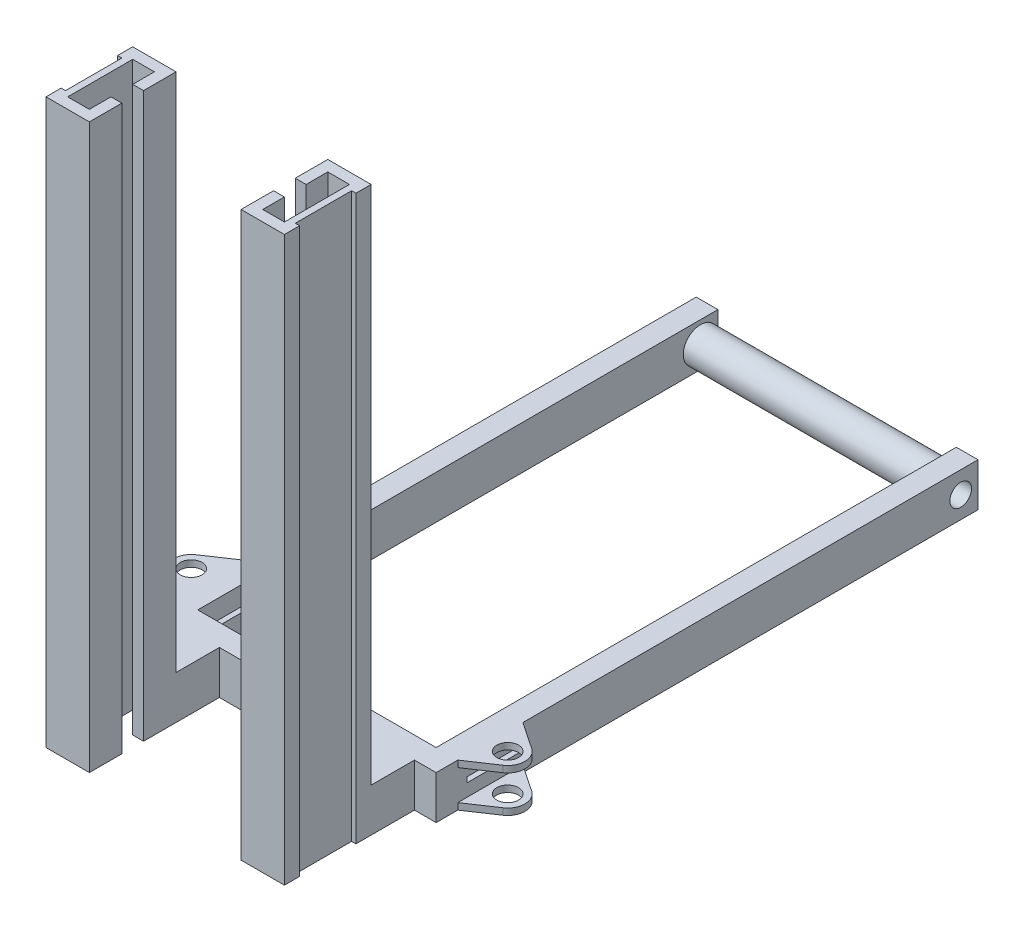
ISO-10303-21;
HEADER;
FILE_DESCRIPTION(('STEP AP214'),'2;1');
FILE_NAME('part.step','',(''),(''),'','','');
FILE_SCHEMA(('AUTOMOTIVE_DESIGN { 1 0 10303 214 1 1 1 1 }'));
ENDSEC;
DATA;
#1=APPLICATION_CONTEXT('core data for automotive mechanical design processes');
#2=APPLICATION_PROTOCOL_DEFINITION('international standard','automotive_design',2000,#1);
#3=PRODUCT_CONTEXT('',#1,'mechanical');
#4=PRODUCT('Part','Part','',(#3));
#5=PRODUCT_RELATED_PRODUCT_CATEGORY('part','',(#4));
#6=PRODUCT_DEFINITION_FORMATION('','',#4);
#7=PRODUCT_DEFINITION_CONTEXT('part definition',#1,'design');
#8=PRODUCT_DEFINITION('design','',#6,#7);
#9=PRODUCT_DEFINITION_SHAPE('','',#8);
#10=(LENGTH_UNIT() NAMED_UNIT(*) SI_UNIT(.MILLI.,.METRE.));
#11=(NAMED_UNIT(*) PLANE_ANGLE_UNIT() SI_UNIT($,.RADIAN.));
#12=(NAMED_UNIT(*) SI_UNIT($,.STERADIAN.) SOLID_ANGLE_UNIT());
#13=UNCERTAINTY_MEASURE_WITH_UNIT(LENGTH_MEASURE(1.E-05),#10,'distance_accuracy_value','');
#14=(GEOMETRIC_REPRESENTATION_CONTEXT(3) GLOBAL_UNCERTAINTY_ASSIGNED_CONTEXT((#13)) GLOBAL_UNIT_ASSIGNED_CONTEXT((#10,
#11,#12)) REPRESENTATION_CONTEXT('',''));
#15=CARTESIAN_POINT('',(0.,0.,0.));
#16=DIRECTION('',(0.,0.,1.));
#17=DIRECTION('',(1.,0.,0.));
#18=AXIS2_PLACEMENT_3D('',#15,#16,#17);
#19=CARTESIAN_POINT('',(0.,0.,0.));
#20=DIRECTION('',(0.,1.,0.));
#21=DIRECTION('',(0.,0.,1.));
#22=AXIS2_PLACEMENT_3D('',#19,#20,#21);
#23=PLANE('',#22);
#24=CARTESIAN_POINT('',(365.,0.,525.000000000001));
#25=DIRECTION('',(0.,-1.,0.));
#26=DIRECTION('',(0.,0.,1.));
#27=AXIS2_PLACEMENT_3D('',#24,#25,#26);
#28=CIRCLE('',#27,25.0000000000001);
#29=CARTESIAN_POINT('',(365.,0.,550.000000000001));
#30=VERTEX_POINT('',#29);
#31=EDGE_CURVE('E861',#30,#30,#28,.T.);
#32=ORIENTED_EDGE('',*,*,#31,.F.);
#33=EDGE_LOOP('',(#32));
#34=FACE_BOUND('',#33,.T.);
#35=CARTESIAN_POINT('',(-365.,0.,525.000000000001));
#36=DIRECTION('',(0.,1.,0.));
#37=DIRECTION('',(0.,0.,1.));
#38=AXIS2_PLACEMENT_3D('',#35,#36,#37);
#39=CIRCLE('',#38,25.0000000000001);
#40=CARTESIAN_POINT('',(-365.,0.,550.000000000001));
#41=VERTEX_POINT('',#40);
#42=EDGE_CURVE('E920',#41,#41,#39,.T.);
#43=ORIENTED_EDGE('',*,*,#42,.T.);
#44=EDGE_LOOP('',(#43));
#45=FACE_BOUND('',#44,.T.);
#46=DIRECTION('',(-1.,0.,0.));
#47=VECTOR('',#46,1.);
#48=CARTESIAN_POINT('',(-265.,0.,915.));
#49=LINE('',#48,#47);
#50=CARTESIAN_POINT('',(-265.,0.,915.));
#51=VERTEX_POINT('',#50);
#52=CARTESIAN_POINT('',(-275.,0.,915.));
#53=VERTEX_POINT('',#52);
#54=EDGE_CURVE('E489',#51,#53,#49,.T.);
#55=ORIENTED_EDGE('',*,*,#54,.F.);
#56=DIRECTION('',(0.,0.,-1.));
#57=VECTOR('',#56,1.);
#58=CARTESIAN_POINT('',(-265.,0.,915.));
#59=LINE('',#58,#57);
#60=CARTESIAN_POINT('',(-265.,0.,785.));
#61=VERTEX_POINT('',#60);
#62=EDGE_CURVE('E474',#51,#61,#59,.T.);
#63=ORIENTED_EDGE('',*,*,#62,.T.);
#64=DIRECTION('',(-1.,0.,0.));
#65=VECTOR('',#64,1.);
#66=CARTESIAN_POINT('',(-265.,0.,785.));
#67=LINE('',#66,#65);
#68=CARTESIAN_POINT('',(-275.,0.,785.));
#69=VERTEX_POINT('',#68);
#70=EDGE_CURVE('E472',#61,#69,#67,.T.);
#71=ORIENTED_EDGE('',*,*,#70,.T.);
#72=DIRECTION('',(0.,0.,-1.));
#73=VECTOR('',#72,1.);
#74=CARTESIAN_POINT('',(-275.,-1.01033360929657E-13,750.));
#75=LINE('',#74,#73);
#76=CARTESIAN_POINT('',(-275.,0.,650.));
#77=VERTEX_POINT('',#76);
#78=EDGE_CURVE('E716',#69,#77,#75,.T.);
#79=ORIENTED_EDGE('',*,*,#78,.T.);
#80=DIRECTION('',(-1.,0.,0.));
#81=VECTOR('',#80,1.);
#82=CARTESIAN_POINT('',(-325.,0.,650.));
#83=LINE('',#82,#81);
#84=CARTESIAN_POINT('',(-325.,0.,650.));
#85=VERTEX_POINT('',#84);
#86=EDGE_CURVE('E729',#77,#85,#83,.T.);
#87=ORIENTED_EDGE('',*,*,#86,.T.);
#88=DIRECTION('',(0.,0.,-1.));
#89=VECTOR('',#88,1.);
#90=CARTESIAN_POINT('',(-325.,0.,600.));
#91=LINE('',#90,#89);
#92=CARTESIAN_POINT('',(-325.,0.,600.));
#93=VERTEX_POINT('',#92);
#94=EDGE_CURVE('E727',#85,#93,#91,.T.);
#95=ORIENTED_EDGE('',*,*,#94,.T.);
#96=DIRECTION('',(0.830449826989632,0.,0.557093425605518));
#97=VECTOR('',#96,1.);
#98=CARTESIAN_POINT('',(-387.283737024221,0.,558.217993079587));
#99=LINE('',#98,#97);
#100=CARTESIAN_POINT('',(-387.283737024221,0.,558.217993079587));
#101=VERTEX_POINT('',#100);
#102=EDGE_CURVE('E926',#101,#93,#99,.T.);
#103=ORIENTED_EDGE('',*,*,#102,.F.);
#104=CARTESIAN_POINT('',(-365.,0.,525.000000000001));
#105=DIRECTION('',(0.,1.,0.));
#106=DIRECTION('',(0.,0.,1.));
#107=AXIS2_PLACEMENT_3D('',#104,#105,#106);
#108=CIRCLE('',#107,40.0000000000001);
#109=CARTESIAN_POINT('',(-387.283737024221,0.,491.782006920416));
#110=VERTEX_POINT('',#109);
#111=EDGE_CURVE('E923',#110,#101,#108,.T.);
#112=ORIENTED_EDGE('',*,*,#111,.F.);
#113=DIRECTION('',(-0.83044982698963,0.,0.557093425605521));
#114=VECTOR('',#113,1.);
#115=CARTESIAN_POINT('',(-387.283737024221,0.,491.782006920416));
#116=LINE('',#115,#114);
#117=CARTESIAN_POINT('',(-325.,0.,450.000000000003));
#118=VERTEX_POINT('',#117);
#119=EDGE_CURVE('E929',#118,#110,#116,.T.);
#120=ORIENTED_EDGE('',*,*,#119,.F.);
#121=DIRECTION('',(0.,0.,1.));
#122=VECTOR('',#121,1.);
#123=CARTESIAN_POINT('',(-325.,0.,-600.));
#124=LINE('',#123,#122);
#125=CARTESIAN_POINT('',(-325.,0.,-600.));
#126=VERTEX_POINT('',#125);
#127=EDGE_CURVE('E984',#126,#118,#124,.T.);
#128=ORIENTED_EDGE('',*,*,#127,.F.);
#129=DIRECTION('',(-1.,0.,0.));
#130=VECTOR('',#129,1.);
#131=CARTESIAN_POINT('',(-325.,0.,-600.));
#132=LINE('',#131,#130);
#133=CARTESIAN_POINT('',(-275.,0.,-600.));
#134=VERTEX_POINT('',#133);
#135=EDGE_CURVE('E992',#134,#126,#132,.T.);
#136=ORIENTED_EDGE('',*,*,#135,.F.);
#137=DIRECTION('',(0.,0.,-1.));
#138=VECTOR('',#137,1.);
#139=CARTESIAN_POINT('',(-275.,0.,-600.));
#140=LINE('',#139,#138);
#141=CARTESIAN_POINT('',(-275.,0.,600.));
#142=VERTEX_POINT('',#141);
#143=EDGE_CURVE('E977',#142,#134,#140,.T.);
#144=ORIENTED_EDGE('',*,*,#143,.F.);
#145=DIRECTION('',(1.,0.,0.));
#146=VECTOR('',#145,1.);
#147=CARTESIAN_POINT('',(-325.,0.,600.));
#148=LINE('',#147,#146);
#149=CARTESIAN_POINT('',(275.,0.,600.));
#150=VERTEX_POINT('',#149);
#151=EDGE_CURVE('E723',#142,#150,#148,.T.);
#152=ORIENTED_EDGE('',*,*,#151,.T.);
#153=DIRECTION('',(0.,0.,1.));
#154=VECTOR('',#153,1.);
#155=CARTESIAN_POINT('',(275.,0.,-600.));
#156=LINE('',#155,#154);
#157=CARTESIAN_POINT('',(275.,0.,-600.));
#158=VERTEX_POINT('',#157);
#159=EDGE_CURVE('E950',#158,#150,#156,.T.);
#160=ORIENTED_EDGE('',*,*,#159,.F.);
#161=DIRECTION('',(-1.,0.,0.));
#162=VECTOR('',#161,1.);
#163=CARTESIAN_POINT('',(325.,0.,-600.));
#164=LINE('',#163,#162);
#165=CARTESIAN_POINT('',(325.,0.,-600.));
#166=VERTEX_POINT('',#165);
#167=EDGE_CURVE('E956',#166,#158,#164,.T.);
#168=ORIENTED_EDGE('',*,*,#167,.F.);
#169=DIRECTION('',(0.,0.,-1.));
#170=VECTOR('',#169,1.);
#171=CARTESIAN_POINT('',(325.,0.,-600.));
#172=LINE('',#171,#170);
#173=CARTESIAN_POINT('',(325.,0.,450.000000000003));
#174=VERTEX_POINT('',#173);
#175=EDGE_CURVE('E944',#174,#166,#172,.T.);
#176=ORIENTED_EDGE('',*,*,#175,.F.);
#177=DIRECTION('',(0.83044982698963,0.,0.557093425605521));
#178=VECTOR('',#177,1.);
#179=CARTESIAN_POINT('',(387.283737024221,0.,491.782006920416));
#180=LINE('',#179,#178);
#181=CARTESIAN_POINT('',(387.283737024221,0.,491.782006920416));
#182=VERTEX_POINT('',#181);
#183=EDGE_CURVE('E854',#174,#182,#180,.T.);
#184=ORIENTED_EDGE('',*,*,#183,.T.);
#185=CARTESIAN_POINT('',(365.,0.,525.000000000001));
#186=DIRECTION('',(0.,-1.,0.));
#187=DIRECTION('',(0.,0.,1.));
#188=AXIS2_PLACEMENT_3D('',#185,#186,#187);
#189=CIRCLE('',#188,40.0000000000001);
#190=CARTESIAN_POINT('',(387.283737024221,0.,558.217993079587));
#191=VERTEX_POINT('',#190);
#192=EDGE_CURVE('E855',#182,#191,#189,.T.);
#193=ORIENTED_EDGE('',*,*,#192,.T.);
#194=DIRECTION('',(-0.830449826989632,0.,0.557093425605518));
#195=VECTOR('',#194,1.);
#196=CARTESIAN_POINT('',(387.283737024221,0.,558.217993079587));
#197=LINE('',#196,#195);
#198=CARTESIAN_POINT('',(325.,0.,600.));
#199=VERTEX_POINT('',#198);
#200=EDGE_CURVE('E851',#191,#199,#197,.T.);
#201=ORIENTED_EDGE('',*,*,#200,.T.);
#202=DIRECTION('',(0.,0.,1.));
#203=VECTOR('',#202,1.);
#204=CARTESIAN_POINT('',(325.,0.,600.));
#205=LINE('',#204,#203);
#206=CARTESIAN_POINT('',(325.,0.,650.));
#207=VERTEX_POINT('',#206);
#208=EDGE_CURVE('E721',#199,#207,#205,.T.);
#209=ORIENTED_EDGE('',*,*,#208,.T.);
#210=CARTESIAN_POINT('',(275.,-1.01033360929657E-13,650.));
#211=VERTEX_POINT('',#210);
#212=EDGE_CURVE('E747',#207,#211,#83,.T.);
#213=ORIENTED_EDGE('',*,*,#212,.T.);
#214=DIRECTION('',(0.,0.,-1.));
#215=VECTOR('',#214,1.);
#216=CARTESIAN_POINT('',(275.,-1.01033360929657E-13,750.));
#217=LINE('',#216,#215);
#218=CARTESIAN_POINT('',(275.,0.,785.));
#219=VERTEX_POINT('',#218);
#220=EDGE_CURVE('E682',#219,#211,#217,.T.);
#221=ORIENTED_EDGE('',*,*,#220,.F.);
#222=DIRECTION('',(1.,0.,0.));
#223=VECTOR('',#222,1.);
#224=CARTESIAN_POINT('',(265.,0.,785.));
#225=LINE('',#224,#223);
#226=CARTESIAN_POINT('',(265.,0.,785.));
#227=VERTEX_POINT('',#226);
#228=EDGE_CURVE('E513',#227,#219,#225,.T.);
#229=ORIENTED_EDGE('',*,*,#228,.F.);
#230=DIRECTION('',(0.,0.,-1.));
#231=VECTOR('',#230,1.);
#232=CARTESIAN_POINT('',(265.,0.,915.));
#233=LINE('',#232,#231);
#234=CARTESIAN_POINT('',(265.,0.,915.));
#235=VERTEX_POINT('',#234);
#236=EDGE_CURVE('E497',#235,#227,#233,.T.);
#237=ORIENTED_EDGE('',*,*,#236,.F.);
#238=DIRECTION('',(1.,0.,0.));
#239=VECTOR('',#238,1.);
#240=CARTESIAN_POINT('',(265.,0.,915.));
#241=LINE('',#240,#239);
#242=CARTESIAN_POINT('',(275.,0.,915.));
#243=VERTEX_POINT('',#242);
#244=EDGE_CURVE('E503',#235,#243,#241,.T.);
#245=ORIENTED_EDGE('',*,*,#244,.T.);
#246=CARTESIAN_POINT('',(275.,0.,950.));
#247=VERTEX_POINT('',#246);
#248=EDGE_CURVE('E688',#247,#243,#217,.T.);
#249=ORIENTED_EDGE('',*,*,#248,.F.);
#250=DIRECTION('',(-1.,0.,0.));
#251=VECTOR('',#250,1.);
#252=CARTESIAN_POINT('',(0.,0.,950.));
#253=LINE('',#252,#251);
#254=CARTESIAN_POINT('',(175.,0.,950.));
#255=VERTEX_POINT('',#254);
#256=EDGE_CURVE('E562',#247,#255,#253,.T.);
#257=ORIENTED_EDGE('',*,*,#256,.T.);
#258=DIRECTION('',(0.,0.,1.));
#259=VECTOR('',#258,1.);
#260=CARTESIAN_POINT('',(175.,0.,0.));
#261=LINE('',#260,#259);
#262=CARTESIAN_POINT('',(175.,0.,875.));
#263=VERTEX_POINT('',#262);
#264=EDGE_CURVE('E559',#263,#255,#261,.T.);
#265=ORIENTED_EDGE('',*,*,#264,.F.);
#266=DIRECTION('',(1.,0.,0.));
#267=VECTOR('',#266,1.);
#268=CARTESIAN_POINT('',(1.94289029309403E-12,0.,875.));
#269=LINE('',#268,#267);
#270=CARTESIAN_POINT('',(200.,0.,875.));
#271=VERTEX_POINT('',#270);
#272=EDGE_CURVE('E556',#263,#271,#269,.T.);
#273=ORIENTED_EDGE('',*,*,#272,.T.);
#274=DIRECTION('',(0.,0.,1.));
#275=VECTOR('',#274,1.);
#276=CARTESIAN_POINT('',(200.,0.,0.));
#277=LINE('',#276,#275);
#278=CARTESIAN_POINT('',(200.,0.,925.));
#279=VERTEX_POINT('',#278);
#280=EDGE_CURVE('E553',#271,#279,#277,.T.);
#281=ORIENTED_EDGE('',*,*,#280,.T.);
#282=DIRECTION('',(-1.,0.,0.));
#283=VECTOR('',#282,1.);
#284=CARTESIAN_POINT('',(0.,0.,925.));
#285=LINE('',#284,#283);
#286=CARTESIAN_POINT('',(250.,0.,925.));
#287=VERTEX_POINT('',#286);
#288=EDGE_CURVE('E550',#287,#279,#285,.T.);
#289=ORIENTED_EDGE('',*,*,#288,.F.);
#290=DIRECTION('',(0.,0.,1.));
#291=VECTOR('',#290,1.);
#292=CARTESIAN_POINT('',(250.,0.,0.));
#293=LINE('',#292,#291);
#294=CARTESIAN_POINT('',(250.,0.,775.));
#295=VERTEX_POINT('',#294);
#296=EDGE_CURVE('E548',#295,#287,#293,.T.);
#297=ORIENTED_EDGE('',*,*,#296,.F.);
#298=DIRECTION('',(-1.,0.,0.));
#299=VECTOR('',#298,1.);
#300=CARTESIAN_POINT('',(0.,0.,775.));
#301=LINE('',#300,#299);
#302=CARTESIAN_POINT('',(200.,0.,775.));
#303=VERTEX_POINT('',#302);
#304=EDGE_CURVE('E509',#295,#303,#301,.T.);
#305=ORIENTED_EDGE('',*,*,#304,.T.);
#306=CARTESIAN_POINT('',(200.,0.,825.));
#307=VERTEX_POINT('',#306);
#308=EDGE_CURVE('E521',#303,#307,#277,.T.);
#309=ORIENTED_EDGE('',*,*,#308,.T.);
#310=DIRECTION('',(1.,0.,0.));
#311=VECTOR('',#310,1.);
#312=CARTESIAN_POINT('',(-1.83186799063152E-12,0.,825.));
#313=LINE('',#312,#311);
#314=CARTESIAN_POINT('',(175.,0.,825.));
#315=VERTEX_POINT('',#314);
#316=EDGE_CURVE('E565',#315,#307,#313,.T.);
#317=ORIENTED_EDGE('',*,*,#316,.F.);
#318=DIRECTION('',(0.,0.,-1.));
#319=VECTOR('',#318,1.);
#320=CARTESIAN_POINT('',(175.,-1.01033360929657E-13,750.));
#321=LINE('',#320,#319);
#322=CARTESIAN_POINT('',(175.,0.,650.));
#323=VERTEX_POINT('',#322);
#324=EDGE_CURVE('E691',#315,#323,#321,.T.);
#325=ORIENTED_EDGE('',*,*,#324,.T.);
#326=CARTESIAN_POINT('',(-175.,0.,650.));
#327=VERTEX_POINT('',#326);
#328=EDGE_CURVE('E751',#323,#327,#83,.T.);
#329=ORIENTED_EDGE('',*,*,#328,.T.);
#330=DIRECTION('',(0.,0.,-1.));
#331=VECTOR('',#330,1.);
#332=CARTESIAN_POINT('',(-175.,-1.01033360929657E-13,750.));
#333=LINE('',#332,#331);
#334=CARTESIAN_POINT('',(-175.,0.,825.));
#335=VERTEX_POINT('',#334);
#336=EDGE_CURVE('E713',#335,#327,#333,.T.);
#337=ORIENTED_EDGE('',*,*,#336,.F.);
#338=DIRECTION('',(-1.,0.,0.));
#339=VECTOR('',#338,1.);
#340=CARTESIAN_POINT('',(1.83186799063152E-12,0.,825.));
#341=LINE('',#340,#339);
#342=CARTESIAN_POINT('',(-200.,0.,825.));
#343=VERTEX_POINT('',#342);
#344=EDGE_CURVE('E632',#335,#343,#341,.T.);
#345=ORIENTED_EDGE('',*,*,#344,.T.);
#346=DIRECTION('',(0.,0.,1.));
#347=VECTOR('',#346,1.);
#348=CARTESIAN_POINT('',(-200.,0.,0.));
#349=LINE('',#348,#347);
#350=CARTESIAN_POINT('',(-200.,0.,775.));
#351=VERTEX_POINT('',#350);
#352=EDGE_CURVE('E629',#351,#343,#349,.T.);
#353=ORIENTED_EDGE('',*,*,#352,.F.);
#354=DIRECTION('',(1.,0.,0.));
#355=VECTOR('',#354,1.);
#356=CARTESIAN_POINT('',(0.,0.,775.));
#357=LINE('',#356,#355);
#358=CARTESIAN_POINT('',(-250.,0.,775.));
#359=VERTEX_POINT('',#358);
#360=EDGE_CURVE('E596',#359,#351,#357,.T.);
#361=ORIENTED_EDGE('',*,*,#360,.F.);
#362=DIRECTION('',(0.,0.,1.));
#363=VECTOR('',#362,1.);
#364=CARTESIAN_POINT('',(-250.,0.,0.));
#365=LINE('',#364,#363);
#366=CARTESIAN_POINT('',(-250.,0.,925.));
#367=VERTEX_POINT('',#366);
#368=EDGE_CURVE('E601',#359,#367,#365,.T.);
#369=ORIENTED_EDGE('',*,*,#368,.T.);
#370=DIRECTION('',(1.,0.,0.));
#371=VECTOR('',#370,1.);
#372=CARTESIAN_POINT('',(0.,0.,925.));
#373=LINE('',#372,#371);
#374=CARTESIAN_POINT('',(-200.,0.,925.));
#375=VERTEX_POINT('',#374);
#376=EDGE_CURVE('E644',#367,#375,#373,.T.);
#377=ORIENTED_EDGE('',*,*,#376,.T.);
#378=CARTESIAN_POINT('',(-200.,0.,875.));
#379=VERTEX_POINT('',#378);
#380=EDGE_CURVE('E633',#379,#375,#349,.T.);
#381=ORIENTED_EDGE('',*,*,#380,.F.);
#382=DIRECTION('',(-1.,0.,0.));
#383=VECTOR('',#382,1.);
#384=CARTESIAN_POINT('',(-1.94289029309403E-12,0.,875.));
#385=LINE('',#384,#383);
#386=CARTESIAN_POINT('',(-175.,0.,875.));
#387=VERTEX_POINT('',#386);
#388=EDGE_CURVE('E640',#387,#379,#385,.T.);
#389=ORIENTED_EDGE('',*,*,#388,.F.);
#390=DIRECTION('',(0.,0.,1.));
#391=VECTOR('',#390,1.);
#392=CARTESIAN_POINT('',(-175.,0.,0.));
#393=LINE('',#392,#391);
#394=CARTESIAN_POINT('',(-175.,0.,950.));
#395=VERTEX_POINT('',#394);
#396=EDGE_CURVE('E637',#387,#395,#393,.T.);
#397=ORIENTED_EDGE('',*,*,#396,.T.);
#398=DIRECTION('',(1.,0.,0.));
#399=VECTOR('',#398,1.);
#400=CARTESIAN_POINT('',(0.,0.,950.));
#401=LINE('',#400,#399);
#402=CARTESIAN_POINT('',(-275.,0.,950.));
#403=VERTEX_POINT('',#402);
#404=EDGE_CURVE('E636',#403,#395,#401,.T.);
#405=ORIENTED_EDGE('',*,*,#404,.F.);
#406=EDGE_CURVE('E717',#403,#53,#75,.T.);
#407=ORIENTED_EDGE('',*,*,#406,.T.);
#408=EDGE_LOOP('',(#55,#63,#71,#79,#87,#95,#103,#112,#120,#128,#136,#144,#152,#160,#168,#176,
#184,#193,#201,#209,#213,#221,#229,#237,#245,#249,#257,#265,#273,#281,#289,#297,#305,#309,#317,
#325,#329,#337,#345,#353,#361,#369,#377,#381,#389,#397,#405,#407));
#409=FACE_BOUND('',#408,.T.);
#410=ADVANCED_FACE('F35',(#34,#45,#409),#23,.F.);
#411=CARTESIAN_POINT('',(-275.,100.,750.));
#412=DIRECTION('',(1.,0.,0.));
#413=DIRECTION('',(0.,0.,-1.));
#414=AXIS2_PLACEMENT_3D('',#411,#412,#413);
#415=PLANE('',#414);
#416=DIRECTION('',(0.,-1.,0.));
#417=VECTOR('',#416,1.);
#418=CARTESIAN_POINT('',(-275.,1300.,915.));
#419=LINE('',#418,#417);
#420=CARTESIAN_POINT('',(-275.,1300.,915.));
#421=VERTEX_POINT('',#420);
#422=EDGE_CURVE('E1332',#421,#53,#419,.T.);
#423=ORIENTED_EDGE('',*,*,#422,.T.);
#424=ORIENTED_EDGE('',*,*,#406,.F.);
#425=DIRECTION('',(0.,-1.,0.));
#426=VECTOR('',#425,1.);
#427=CARTESIAN_POINT('',(-275.,1300.,950.));
#428=LINE('',#427,#426);
#429=CARTESIAN_POINT('',(-275.,1300.,950.));
#430=VERTEX_POINT('',#429);
#431=EDGE_CURVE('E661',#430,#403,#428,.T.);
#432=ORIENTED_EDGE('',*,*,#431,.F.);
#433=DIRECTION('',(0.,0.,1.));
#434=VECTOR('',#433,1.);
#435=CARTESIAN_POINT('',(-275.,1300.,0.));
#436=LINE('',#435,#434);
#437=EDGE_CURVE('E614',#421,#430,#436,.T.);
#438=ORIENTED_EDGE('',*,*,#437,.F.);
#439=EDGE_LOOP('',(#423,#424,#432,#438));
#440=FACE_BOUND('',#439,.T.);
#441=ADVANCED_FACE('F1177',(#440),#415,.F.);
#442=DIRECTION('',(0.,1.,0.));
#443=VECTOR('',#442,1.);
#444=CARTESIAN_POINT('',(-275.,1300.,785.));
#445=LINE('',#444,#443);
#446=CARTESIAN_POINT('',(-275.,1300.,785.));
#447=VERTEX_POINT('',#446);
#448=EDGE_CURVE('E1334',#69,#447,#445,.T.);
#449=ORIENTED_EDGE('',*,*,#448,.T.);
#450=CARTESIAN_POINT('',(-275.,1300.,750.));
#451=VERTEX_POINT('',#450);
#452=EDGE_CURVE('E486',#451,#447,#436,.T.);
#453=ORIENTED_EDGE('',*,*,#452,.F.);
#454=DIRECTION('',(0.,-1.,0.));
#455=VECTOR('',#454,1.);
#456=CARTESIAN_POINT('',(-275.,1300.,750.));
#457=LINE('',#456,#455);
#458=CARTESIAN_POINT('',(-275.,100.,750.));
#459=VERTEX_POINT('',#458);
#460=EDGE_CURVE('E664',#451,#459,#457,.T.);
#461=ORIENTED_EDGE('',*,*,#460,.T.);
#462=DIRECTION('',(0.,0.,-1.));
#463=VECTOR('',#462,1.);
#464=CARTESIAN_POINT('',(-275.,100.,750.));
#465=LINE('',#464,#463);
#466=CARTESIAN_POINT('',(-275.,100.,650.));
#467=VERTEX_POINT('',#466);
#468=EDGE_CURVE('E702',#459,#467,#465,.T.);
#469=ORIENTED_EDGE('',*,*,#468,.T.);
#470=DIRECTION('',(0.,-1.,0.));
#471=VECTOR('',#470,1.);
#472=CARTESIAN_POINT('',(-275.,100.,650.));
#473=LINE('',#472,#471);
#474=EDGE_CURVE('E698',#467,#77,#473,.T.);
#475=ORIENTED_EDGE('',*,*,#474,.T.);
#476=ORIENTED_EDGE('',*,*,#78,.F.);
#477=EDGE_LOOP('',(#449,#453,#461,#469,#475,#476));
#478=FACE_BOUND('',#477,.T.);
#479=ADVANCED_FACE('F1184',(#478),#415,.F.);
#480=CARTESIAN_POINT('',(0.,1300.,0.));
#481=DIRECTION('',(0.,1.,0.));
#482=DIRECTION('',(0.,0.,1.));
#483=AXIS2_PLACEMENT_3D('',#480,#481,#482);
#484=PLANE('',#483);
#485=DIRECTION('',(0.,0.,1.));
#486=VECTOR('',#485,1.);
#487=CARTESIAN_POINT('',(-265.,1300.,915.));
#488=LINE('',#487,#486);
#489=CARTESIAN_POINT('',(-265.,1300.,785.));
#490=VERTEX_POINT('',#489);
#491=CARTESIAN_POINT('',(-265.,1300.,915.));
#492=VERTEX_POINT('',#491);
#493=EDGE_CURVE('E475',#490,#492,#488,.T.);
#494=ORIENTED_EDGE('',*,*,#493,.T.);
#495=DIRECTION('',(-1.,0.,0.));
#496=VECTOR('',#495,1.);
#497=CARTESIAN_POINT('',(-265.,1300.,915.));
#498=LINE('',#497,#496);
#499=EDGE_CURVE('E487',#492,#421,#498,.T.);
#500=ORIENTED_EDGE('',*,*,#499,.T.);
#501=ORIENTED_EDGE('',*,*,#437,.T.);
#502=DIRECTION('',(1.,0.,0.));
#503=VECTOR('',#502,1.);
#504=CARTESIAN_POINT('',(0.,1300.,950.));
#505=LINE('',#504,#503);
#506=CARTESIAN_POINT('',(-175.,1300.,950.));
#507=VERTEX_POINT('',#506);
#508=EDGE_CURVE('E616',#430,#507,#505,.T.);
#509=ORIENTED_EDGE('',*,*,#508,.T.);
#510=DIRECTION('',(0.,0.,1.));
#511=VECTOR('',#510,1.);
#512=CARTESIAN_POINT('',(-175.,1300.,0.));
#513=LINE('',#512,#511);
#514=CARTESIAN_POINT('',(-175.,1300.,875.));
#515=VERTEX_POINT('',#514);
#516=EDGE_CURVE('E611',#515,#507,#513,.T.);
#517=ORIENTED_EDGE('',*,*,#516,.F.);
#518=DIRECTION('',(-1.,0.,0.));
#519=VECTOR('',#518,1.);
#520=CARTESIAN_POINT('',(-1.94289029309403E-12,1300.,875.));
#521=LINE('',#520,#519);
#522=CARTESIAN_POINT('',(-200.,1300.,875.));
#523=VERTEX_POINT('',#522);
#524=EDGE_CURVE('E618',#515,#523,#521,.T.);
#525=ORIENTED_EDGE('',*,*,#524,.T.);
#526=DIRECTION('',(0.,0.,1.));
#527=VECTOR('',#526,1.);
#528=CARTESIAN_POINT('',(-200.,1300.,0.));
#529=LINE('',#528,#527);
#530=CARTESIAN_POINT('',(-200.,1300.,925.));
#531=VERTEX_POINT('',#530);
#532=EDGE_CURVE('E604',#523,#531,#529,.T.);
#533=ORIENTED_EDGE('',*,*,#532,.T.);
#534=DIRECTION('',(1.,0.,0.));
#535=VECTOR('',#534,1.);
#536=CARTESIAN_POINT('',(0.,1300.,925.));
#537=LINE('',#536,#535);
#538=CARTESIAN_POINT('',(-250.,1300.,925.));
#539=VERTEX_POINT('',#538);
#540=EDGE_CURVE('E620',#539,#531,#537,.T.);
#541=ORIENTED_EDGE('',*,*,#540,.F.);
#542=DIRECTION('',(0.,0.,1.));
#543=VECTOR('',#542,1.);
#544=CARTESIAN_POINT('',(-250.,1300.,0.));
#545=LINE('',#544,#543);
#546=CARTESIAN_POINT('',(-250.,1300.,775.));
#547=VERTEX_POINT('',#546);
#548=EDGE_CURVE('E623',#547,#539,#545,.T.);
#549=ORIENTED_EDGE('',*,*,#548,.F.);
#550=DIRECTION('',(1.,0.,0.));
#551=VECTOR('',#550,1.);
#552=CARTESIAN_POINT('',(0.,1300.,775.));
#553=LINE('',#552,#551);
#554=CARTESIAN_POINT('',(-200.,1300.,775.));
#555=VERTEX_POINT('',#554);
#556=EDGE_CURVE('E597',#547,#555,#553,.T.);
#557=ORIENTED_EDGE('',*,*,#556,.T.);
#558=CARTESIAN_POINT('',(-200.,1300.,825.));
#559=VERTEX_POINT('',#558);
#560=EDGE_CURVE('E600',#555,#559,#529,.T.);
#561=ORIENTED_EDGE('',*,*,#560,.T.);
#562=DIRECTION('',(-1.,0.,0.));
#563=VECTOR('',#562,1.);
#564=CARTESIAN_POINT('',(1.83186799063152E-12,1300.,825.));
#565=LINE('',#564,#563);
#566=CARTESIAN_POINT('',(-175.,1300.,825.));
#567=VERTEX_POINT('',#566);
#568=EDGE_CURVE('E603',#567,#559,#565,.T.);
#569=ORIENTED_EDGE('',*,*,#568,.F.);
#570=CARTESIAN_POINT('',(-175.,1300.,750.));
#571=VERTEX_POINT('',#570);
#572=EDGE_CURVE('E607',#571,#567,#513,.T.);
#573=ORIENTED_EDGE('',*,*,#572,.F.);
#574=DIRECTION('',(1.,0.,0.));
#575=VECTOR('',#574,1.);
#576=CARTESIAN_POINT('',(0.,1300.,750.));
#577=LINE('',#576,#575);
#578=EDGE_CURVE('E610',#451,#571,#577,.T.);
#579=ORIENTED_EDGE('',*,*,#578,.F.);
#580=ORIENTED_EDGE('',*,*,#452,.T.);
#581=DIRECTION('',(-1.,0.,0.));
#582=VECTOR('',#581,1.);
#583=CARTESIAN_POINT('',(-265.,1300.,785.));
#584=LINE('',#583,#582);
#585=EDGE_CURVE('E469',#490,#447,#584,.T.);
#586=ORIENTED_EDGE('',*,*,#585,.F.);
#587=EDGE_LOOP('',(#494,#500,#501,#509,#517,#525,#533,#541,#549,#557,#561,#569,#573,#579,#580,#586));
#588=FACE_BOUND('',#587,.T.);
#589=ADVANCED_FACE('F483',(#588),#484,.T.);
#590=CARTESIAN_POINT('',(275.,100.,750.));
#591=DIRECTION('',(1.,0.,0.));
#592=DIRECTION('',(0.,0.,-1.));
#593=AXIS2_PLACEMENT_3D('',#590,#591,#592);
#594=PLANE('',#593);
#595=DIRECTION('',(0.,-1.,0.));
#596=VECTOR('',#595,1.);
#597=CARTESIAN_POINT('',(275.,1300.,915.));
#598=LINE('',#597,#596);
#599=CARTESIAN_POINT('',(275.,1300.,915.));
#600=VERTEX_POINT('',#599);
#601=EDGE_CURVE('E504',#600,#243,#598,.T.);
#602=ORIENTED_EDGE('',*,*,#601,.F.);
#603=DIRECTION('',(0.,0.,1.));
#604=VECTOR('',#603,1.);
#605=CARTESIAN_POINT('',(275.,1300.,0.));
#606=LINE('',#605,#604);
#607=CARTESIAN_POINT('',(275.,1300.,950.));
#608=VERTEX_POINT('',#607);
#609=EDGE_CURVE('E538',#600,#608,#606,.T.);
#610=ORIENTED_EDGE('',*,*,#609,.T.);
#611=DIRECTION('',(0.,-1.,0.));
#612=VECTOR('',#611,1.);
#613=CARTESIAN_POINT('',(275.,1300.,950.));
#614=LINE('',#613,#612);
#615=EDGE_CURVE('E580',#608,#247,#614,.T.);
#616=ORIENTED_EDGE('',*,*,#615,.T.);
#617=ORIENTED_EDGE('',*,*,#248,.T.);
#618=EDGE_LOOP('',(#602,#610,#616,#617));
#619=FACE_BOUND('',#618,.T.);
#620=ADVANCED_FACE('F1082',(#619),#594,.T.);
#621=CARTESIAN_POINT('',(-325.,-651.920240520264,650.));
#622=DIRECTION('',(0.,0.,1.));
#623=DIRECTION('',(1.,0.,0.));
#624=AXIS2_PLACEMENT_3D('',#621,#622,#623);
#625=PLANE('',#624);
#626=DIRECTION('',(0.,-1.,0.));
#627=VECTOR('',#626,1.);
#628=CARTESIAN_POINT('',(275.,100.,650.));
#629=LINE('',#628,#627);
#630=CARTESIAN_POINT('',(275.,100.,650.));
#631=VERTEX_POINT('',#630);
#632=EDGE_CURVE('E678',#631,#211,#629,.T.);
#633=ORIENTED_EDGE('',*,*,#632,.T.);
#634=ORIENTED_EDGE('',*,*,#212,.F.);
#635=DIRECTION('',(0.,1.,0.));
#636=VECTOR('',#635,1.);
#637=CARTESIAN_POINT('',(325.,-651.920240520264,650.));
#638=LINE('',#637,#636);
#639=CARTESIAN_POINT('',(325.,100.,650.));
#640=VERTEX_POINT('',#639);
#641=EDGE_CURVE('E724',#207,#640,#638,.T.);
#642=ORIENTED_EDGE('',*,*,#641,.T.);
#643=DIRECTION('',(1.,0.,0.));
#644=VECTOR('',#643,1.);
#645=CARTESIAN_POINT('',(-325.,100.,650.));
#646=LINE('',#645,#644);
#647=EDGE_CURVE('E732',#631,#640,#646,.T.);
#648=ORIENTED_EDGE('',*,*,#647,.F.);
#649=EDGE_LOOP('',(#633,#634,#642,#648));
#650=FACE_BOUND('',#649,.T.);
#651=ADVANCED_FACE('F1062',(#650),#625,.T.);
#652=ORIENTED_EDGE('',*,*,#474,.F.);
#653=CARTESIAN_POINT('',(-325.,100.,650.));
#654=VERTEX_POINT('',#653);
#655=EDGE_CURVE('E733',#654,#467,#646,.T.);
#656=ORIENTED_EDGE('',*,*,#655,.F.);
#657=DIRECTION('',(0.,1.,0.));
#658=VECTOR('',#657,1.);
#659=CARTESIAN_POINT('',(-325.,-651.920240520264,650.));
#660=LINE('',#659,#658);
#661=EDGE_CURVE('E743',#85,#654,#660,.T.);
#662=ORIENTED_EDGE('',*,*,#661,.F.);
#663=ORIENTED_EDGE('',*,*,#86,.F.);
#664=EDGE_LOOP('',(#652,#656,#662,#663));
#665=FACE_BOUND('',#664,.T.);
#666=ADVANCED_FACE('F1144',(#665),#625,.T.);
#667=CARTESIAN_POINT('',(325.,100.,-600.));
#668=DIRECTION('',(-1.,0.,0.));
#669=DIRECTION('',(0.,0.,1.));
#670=AXIS2_PLACEMENT_3D('',#667,#668,#669);
#671=PLANE('',#670);
#672=DIRECTION('',(0.,0.,-1.));
#673=VECTOR('',#672,1.);
#674=CARTESIAN_POINT('',(325.,100.,-600.));
#675=LINE('',#674,#673);
#676=CARTESIAN_POINT('',(325.,100.,450.000000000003));
#677=VERTEX_POINT('',#676);
#678=CARTESIAN_POINT('',(325.,100.,-600.));
#679=VERTEX_POINT('',#678);
#680=EDGE_CURVE('E947',#677,#679,#675,.T.);
#681=ORIENTED_EDGE('',*,*,#680,.F.);
#682=DIRECTION('',(0.,-1.,0.));
#683=VECTOR('',#682,1.);
#684=CARTESIAN_POINT('',(325.,269.999999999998,450.000000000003));
#685=LINE('',#684,#683);
#686=CARTESIAN_POINT('',(325.,85.,450.000000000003));
#687=VERTEX_POINT('',#686);
#688=EDGE_CURVE('E869',#677,#687,#685,.T.);
#689=ORIENTED_EDGE('',*,*,#688,.T.);
#690=DIRECTION('',(0.,0.,-1.));
#691=VECTOR('',#690,1.);
#692=CARTESIAN_POINT('',(325.,85.,450.000000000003));
#693=LINE('',#692,#691);
#694=CARTESIAN_POINT('',(325.,85.,600.));
#695=VERTEX_POINT('',#694);
#696=EDGE_CURVE('E835',#695,#687,#693,.T.);
#697=ORIENTED_EDGE('',*,*,#696,.F.);
#698=DIRECTION('',(0.,-1.,0.));
#699=VECTOR('',#698,1.);
#700=CARTESIAN_POINT('',(325.,100.,600.));
#701=LINE('',#700,#699);
#702=CARTESIAN_POINT('',(325.,100.,600.));
#703=VERTEX_POINT('',#702);
#704=EDGE_CURVE('E960',#703,#695,#701,.T.);
#705=ORIENTED_EDGE('',*,*,#704,.F.);
#706=DIRECTION('',(0.,0.,-1.));
#707=VECTOR('',#706,1.);
#708=CARTESIAN_POINT('',(325.,100.,600.));
#709=LINE('',#708,#707);
#710=EDGE_CURVE('E736',#640,#703,#709,.T.);
#711=ORIENTED_EDGE('',*,*,#710,.F.);
#712=ORIENTED_EDGE('',*,*,#641,.F.);
#713=ORIENTED_EDGE('',*,*,#208,.F.);
#714=CARTESIAN_POINT('',(325.,15.,600.));
#715=VERTEX_POINT('',#714);
#716=EDGE_CURVE('E954',#715,#199,#701,.T.);
#717=ORIENTED_EDGE('',*,*,#716,.F.);
#718=DIRECTION('',(0.,0.,-1.));
#719=VECTOR('',#718,1.);
#720=CARTESIAN_POINT('',(325.,15.,450.000000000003));
#721=LINE('',#720,#719);
#722=CARTESIAN_POINT('',(325.,15.,450.000000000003));
#723=VERTEX_POINT('',#722);
#724=EDGE_CURVE('E846',#715,#723,#721,.T.);
#725=ORIENTED_EDGE('',*,*,#724,.T.);
#726=EDGE_CURVE('E881',#723,#174,#685,.T.);
#727=ORIENTED_EDGE('',*,*,#726,.T.);
#728=ORIENTED_EDGE('',*,*,#175,.T.);
#729=DIRECTION('',(0.,-1.,0.));
#730=VECTOR('',#729,1.);
#731=CARTESIAN_POINT('',(325.,100.,-600.));
#732=LINE('',#731,#730);
#733=EDGE_CURVE('E970',#679,#166,#732,.T.);
#734=ORIENTED_EDGE('',*,*,#733,.F.);
#735=EDGE_LOOP('',(#681,#689,#697,#705,#711,#712,#713,#717,#725,#727,#728,#734));
#736=FACE_BOUND('',#735,.T.);
#737=CARTESIAN_POINT('',(325.,50.,-560.));
#738=DIRECTION('',(-1.,0.,0.));
#739=DIRECTION('',(0.,0.,1.));
#740=AXIS2_PLACEMENT_3D('',#737,#738,#739);
#741=CIRCLE('',#740,25.);
#742=CARTESIAN_POINT('',(325.,50.,-535.));
#743=VERTEX_POINT('',#742);
#744=EDGE_CURVE('E809',#743,#743,#741,.F.);
#745=ORIENTED_EDGE('',*,*,#744,.F.);
#746=EDGE_LOOP('',(#745));
#747=FACE_BOUND('',#746,.T.);
#748=DIRECTION('',(0.,0.,1.));
#749=VECTOR('',#748,1.);
#750=CARTESIAN_POINT('',(325.,44.,447.429418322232));
#751=LINE('',#750,#749);
#752=CARTESIAN_POINT('',(325.,44.,447.429418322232));
#753=VERTEX_POINT('',#752);
#754=CARTESIAN_POINT('',(325.,44.,578.369428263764));
#755=VERTEX_POINT('',#754);
#756=EDGE_CURVE('E761',#753,#755,#751,.T.);
#757=ORIENTED_EDGE('',*,*,#756,.T.);
#758=DIRECTION('',(0.,1.,0.));
#759=VECTOR('',#758,1.);
#760=CARTESIAN_POINT('',(325.,44.,578.369428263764));
#761=LINE('',#760,#759);
#762=CARTESIAN_POINT('',(325.,56.,578.369428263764));
#763=VERTEX_POINT('',#762);
#764=EDGE_CURVE('E776',#755,#763,#761,.T.);
#765=ORIENTED_EDGE('',*,*,#764,.T.);
#766=DIRECTION('',(0.,0.,1.));
#767=VECTOR('',#766,1.);
#768=CARTESIAN_POINT('',(325.,56.,447.429418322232));
#769=LINE('',#768,#767);
#770=CARTESIAN_POINT('',(325.,56.,447.429418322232));
#771=VERTEX_POINT('',#770);
#772=EDGE_CURVE('E756',#771,#763,#769,.T.);
#773=ORIENTED_EDGE('',*,*,#772,.F.);
#774=DIRECTION('',(0.,1.,0.));
#775=VECTOR('',#774,1.);
#776=CARTESIAN_POINT('',(325.,44.,447.429418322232));
#777=LINE('',#776,#775);
#778=EDGE_CURVE('E772',#753,#771,#777,.T.);
#779=ORIENTED_EDGE('',*,*,#778,.F.);
#780=EDGE_LOOP('',(#757,#765,#773,#779));
#781=FACE_BOUND('',#780,.T.);
#782=ADVANCED_FACE('F1041',(#736,#747,#781),#671,.F.);
#783=CARTESIAN_POINT('',(275.,100.,-600.));
#784=DIRECTION('',(1.,0.,0.));
#785=DIRECTION('',(0.,0.,-1.));
#786=AXIS2_PLACEMENT_3D('',#783,#784,#785);
#787=PLANE('',#786);
#788=DIRECTION('',(0.,-1.,0.));
#789=VECTOR('',#788,1.);
#790=CARTESIAN_POINT('',(275.,100.,-600.));
#791=LINE('',#790,#789);
#792=CARTESIAN_POINT('',(275.,100.,-600.));
#793=VERTEX_POINT('',#792);
#794=CARTESIAN_POINT('',(275.,50.,-600.));
#795=VERTEX_POINT('',#794);
#796=EDGE_CURVE('E967',#793,#795,#791,.T.);
#797=ORIENTED_EDGE('',*,*,#796,.T.);
#798=CARTESIAN_POINT('',(275.,50.,-560.));
#799=DIRECTION('',(1.,0.,0.));
#800=DIRECTION('',(0.,0.,-1.));
#801=AXIS2_PLACEMENT_3D('',#798,#799,#800);
#802=CIRCLE('',#801,40.);
#803=EDGE_CURVE('E974',#795,#795,#802,.T.);
#804=ORIENTED_EDGE('',*,*,#803,.T.);
#805=EDGE_CURVE('E966',#795,#158,#791,.T.);
#806=ORIENTED_EDGE('',*,*,#805,.T.);
#807=ORIENTED_EDGE('',*,*,#159,.T.);
#808=DIRECTION('',(0.,-1.,0.));
#809=VECTOR('',#808,1.);
#810=CARTESIAN_POINT('',(275.,100.,600.));
#811=LINE('',#810,#809);
#812=CARTESIAN_POINT('',(275.,100.,600.));
#813=VERTEX_POINT('',#812);
#814=EDGE_CURVE('E963',#813,#150,#811,.T.);
#815=ORIENTED_EDGE('',*,*,#814,.F.);
#816=DIRECTION('',(0.,0.,1.));
#817=VECTOR('',#816,1.);
#818=CARTESIAN_POINT('',(275.,100.,-600.));
#819=LINE('',#818,#817);
#820=EDGE_CURVE('E952',#793,#813,#819,.T.);
#821=ORIENTED_EDGE('',*,*,#820,.F.);
#822=EDGE_LOOP('',(#797,#804,#806,#807,#815,#821));
#823=FACE_BOUND('',#822,.T.);
#824=DIRECTION('',(0.,0.,-1.));
#825=VECTOR('',#824,1.);
#826=CARTESIAN_POINT('',(275.,44.,447.429418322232));
#827=LINE('',#826,#825);
#828=CARTESIAN_POINT('',(275.,44.,578.369428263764));
#829=VERTEX_POINT('',#828);
#830=CARTESIAN_POINT('',(275.,44.,447.429418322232));
#831=VERTEX_POINT('',#830);
#832=EDGE_CURVE('E755',#829,#831,#827,.T.);
#833=ORIENTED_EDGE('',*,*,#832,.T.);
#834=DIRECTION('',(0.,1.,0.));
#835=VECTOR('',#834,1.);
#836=CARTESIAN_POINT('',(275.,44.,447.429418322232));
#837=LINE('',#836,#835);
#838=CARTESIAN_POINT('',(275.,56.,447.429418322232));
#839=VERTEX_POINT('',#838);
#840=EDGE_CURVE('E764',#831,#839,#837,.T.);
#841=ORIENTED_EDGE('',*,*,#840,.T.);
#842=DIRECTION('',(0.,0.,-1.));
#843=VECTOR('',#842,1.);
#844=CARTESIAN_POINT('',(275.,56.,447.429418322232));
#845=LINE('',#844,#843);
#846=CARTESIAN_POINT('',(275.,56.,578.369428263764));
#847=VERTEX_POINT('',#846);
#848=EDGE_CURVE('E766',#847,#839,#845,.T.);
#849=ORIENTED_EDGE('',*,*,#848,.F.);
#850=DIRECTION('',(0.,1.,0.));
#851=VECTOR('',#850,1.);
#852=CARTESIAN_POINT('',(275.,44.,578.369428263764));
#853=LINE('',#852,#851);
#854=EDGE_CURVE('E779',#829,#847,#853,.T.);
#855=ORIENTED_EDGE('',*,*,#854,.F.);
#856=EDGE_LOOP('',(#833,#841,#849,#855));
#857=FACE_BOUND('',#856,.T.);
#858=ADVANCED_FACE('F1030',(#823,#857),#787,.F.);
#859=CARTESIAN_POINT('',(-325.,100.,-600.));
#860=DIRECTION('',(1.,0.,0.));
#861=DIRECTION('',(0.,0.,-1.));
#862=AXIS2_PLACEMENT_3D('',#859,#860,#861);
#863=PLANE('',#862);
#864=DIRECTION('',(0.,-1.,0.));
#865=VECTOR('',#864,1.);
#866=CARTESIAN_POINT('',(-325.,269.999999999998,450.000000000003));
#867=LINE('',#866,#865);
#868=CARTESIAN_POINT('',(-325.,100.,450.000000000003));
#869=VERTEX_POINT('',#868);
#870=CARTESIAN_POINT('',(-325.,85.,450.000000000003));
#871=VERTEX_POINT('',#870);
#872=EDGE_CURVE('E937',#869,#871,#867,.T.);
#873=ORIENTED_EDGE('',*,*,#872,.F.);
#874=DIRECTION('',(0.,0.,1.));
#875=VECTOR('',#874,1.);
#876=CARTESIAN_POINT('',(-325.,100.,-600.));
#877=LINE('',#876,#875);
#878=CARTESIAN_POINT('',(-325.,100.,-600.));
#879=VERTEX_POINT('',#878);
#880=EDGE_CURVE('E986',#879,#869,#877,.T.);
#881=ORIENTED_EDGE('',*,*,#880,.F.);
#882=DIRECTION('',(0.,-1.,0.));
#883=VECTOR('',#882,1.);
#884=CARTESIAN_POINT('',(-325.,100.,-600.));
#885=LINE('',#884,#883);
#886=EDGE_CURVE('E1000',#879,#126,#885,.T.);
#887=ORIENTED_EDGE('',*,*,#886,.T.);
#888=ORIENTED_EDGE('',*,*,#127,.T.);
#889=CARTESIAN_POINT('',(-325.,15.,450.000000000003));
#890=VERTEX_POINT('',#889);
#891=EDGE_CURVE('E936',#890,#118,#867,.T.);
#892=ORIENTED_EDGE('',*,*,#891,.F.);
#893=DIRECTION('',(0.,0.,-1.));
#894=VECTOR('',#893,1.);
#895=CARTESIAN_POINT('',(-325.,15.,450.000000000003));
#896=LINE('',#895,#894);
#897=CARTESIAN_POINT('',(-325.,15.,600.));
#898=VERTEX_POINT('',#897);
#899=EDGE_CURVE('E908',#898,#890,#896,.T.);
#900=ORIENTED_EDGE('',*,*,#899,.F.);
#901=DIRECTION('',(0.,-1.,0.));
#902=VECTOR('',#901,1.);
#903=CARTESIAN_POINT('',(-325.,100.,600.));
#904=LINE('',#903,#902);
#905=EDGE_CURVE('E998',#898,#93,#904,.T.);
#906=ORIENTED_EDGE('',*,*,#905,.T.);
#907=ORIENTED_EDGE('',*,*,#94,.F.);
#908=ORIENTED_EDGE('',*,*,#661,.T.);
#909=DIRECTION('',(0.,0.,1.));
#910=VECTOR('',#909,1.);
#911=CARTESIAN_POINT('',(-325.,100.,600.));
#912=LINE('',#911,#910);
#913=CARTESIAN_POINT('',(-325.,100.,600.));
#914=VERTEX_POINT('',#913);
#915=EDGE_CURVE('E720',#914,#654,#912,.T.);
#916=ORIENTED_EDGE('',*,*,#915,.F.);
#917=CARTESIAN_POINT('',(-325.,85.,600.));
#918=VERTEX_POINT('',#917);
#919=EDGE_CURVE('E999',#914,#918,#904,.T.);
#920=ORIENTED_EDGE('',*,*,#919,.T.);
#921=DIRECTION('',(0.,0.,-1.));
#922=VECTOR('',#921,1.);
#923=CARTESIAN_POINT('',(-325.,85.,450.000000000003));
#924=LINE('',#923,#922);
#925=EDGE_CURVE('E899',#918,#871,#924,.T.);
#926=ORIENTED_EDGE('',*,*,#925,.T.);
#927=EDGE_LOOP('',(#873,#881,#887,#888,#892,#900,#906,#907,#908,#916,#920,#926));
#928=FACE_BOUND('',#927,.T.);
#929=CARTESIAN_POINT('',(-325.,50.,-560.));
#930=DIRECTION('',(1.,0.,0.));
#931=DIRECTION('',(0.,0.,-1.));
#932=AXIS2_PLACEMENT_3D('',#929,#930,#931);
#933=CIRCLE('',#932,25.);
#934=CARTESIAN_POINT('',(-325.,50.,-585.));
#935=VERTEX_POINT('',#934);
#936=EDGE_CURVE('E820',#935,#935,#933,.F.);
#937=ORIENTED_EDGE('',*,*,#936,.F.);
#938=EDGE_LOOP('',(#937));
#939=FACE_BOUND('',#938,.T.);
#940=DIRECTION('',(0.,0.,1.));
#941=VECTOR('',#940,1.);
#942=CARTESIAN_POINT('',(-325.,44.,447.429418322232));
#943=LINE('',#942,#941);
#944=CARTESIAN_POINT('',(-325.,44.,447.429418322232));
#945=VERTEX_POINT('',#944);
#946=CARTESIAN_POINT('',(-325.,44.,578.369428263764));
#947=VERTEX_POINT('',#946);
#948=EDGE_CURVE('E786',#945,#947,#943,.T.);
#949=ORIENTED_EDGE('',*,*,#948,.F.);
#950=DIRECTION('',(0.,1.,0.));
#951=VECTOR('',#950,1.);
#952=CARTESIAN_POINT('',(-325.,44.,447.429418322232));
#953=LINE('',#952,#951);
#954=CARTESIAN_POINT('',(-325.,56.,447.429418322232));
#955=VERTEX_POINT('',#954);
#956=EDGE_CURVE('E796',#945,#955,#953,.T.);
#957=ORIENTED_EDGE('',*,*,#956,.T.);
#958=DIRECTION('',(0.,0.,1.));
#959=VECTOR('',#958,1.);
#960=CARTESIAN_POINT('',(-325.,56.,447.429418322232));
#961=LINE('',#960,#959);
#962=CARTESIAN_POINT('',(-325.,56.,578.369428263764));
#963=VERTEX_POINT('',#962);
#964=EDGE_CURVE('E799',#955,#963,#961,.T.);
#965=ORIENTED_EDGE('',*,*,#964,.T.);
#966=DIRECTION('',(0.,1.,0.));
#967=VECTOR('',#966,1.);
#968=CARTESIAN_POINT('',(-325.,44.,578.369428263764));
#969=LINE('',#968,#967);
#970=EDGE_CURVE('E813',#947,#963,#969,.T.);
#971=ORIENTED_EDGE('',*,*,#970,.F.);
#972=EDGE_LOOP('',(#949,#957,#965,#971));
#973=FACE_BOUND('',#972,.T.);
#974=ADVANCED_FACE('F1139',(#928,#939,#973),#863,.F.);
#975=CARTESIAN_POINT('',(-275.,100.,-600.));
#976=DIRECTION('',(-1.,0.,0.));
#977=DIRECTION('',(0.,0.,1.));
#978=AXIS2_PLACEMENT_3D('',#975,#976,#977);
#979=PLANE('',#978);
#980=DIRECTION('',(0.,-1.,0.));
#981=VECTOR('',#980,1.);
#982=CARTESIAN_POINT('',(-275.,100.,-600.));
#983=LINE('',#982,#981);
#984=CARTESIAN_POINT('',(-275.,50.,-600.));
#985=VERTEX_POINT('',#984);
#986=EDGE_CURVE('E43',#985,#134,#983,.T.);
#987=ORIENTED_EDGE('',*,*,#986,.F.);
#988=CARTESIAN_POINT('',(-275.,50.,-560.));
#989=DIRECTION('',(1.,0.,0.));
#990=DIRECTION('',(0.,0.,-1.));
#991=AXIS2_PLACEMENT_3D('',#988,#989,#990);
#992=CIRCLE('',#991,40.);
#993=EDGE_CURVE('E973',#985,#985,#992,.T.);
#994=ORIENTED_EDGE('',*,*,#993,.F.);
#995=CARTESIAN_POINT('',(-275.,100.,-600.));
#996=VERTEX_POINT('',#995);
#997=EDGE_CURVE('E11',#996,#985,#983,.T.);
#998=ORIENTED_EDGE('',*,*,#997,.F.);
#999=DIRECTION('',(0.,0.,-1.));
#1000=VECTOR('',#999,1.);
#1001=CARTESIAN_POINT('',(-275.,100.,-600.));
#1002=LINE('',#1001,#1000);
#1003=CARTESIAN_POINT('',(-275.,100.,600.));
#1004=VERTEX_POINT('',#1003);
#1005=EDGE_CURVE('E980',#1004,#996,#1002,.T.);
#1006=ORIENTED_EDGE('',*,*,#1005,.F.);
#1007=DIRECTION('',(0.,-1.,0.));
#1008=VECTOR('',#1007,1.);
#1009=CARTESIAN_POINT('',(-275.,100.,600.));
#1010=LINE('',#1009,#1008);
#1011=EDGE_CURVE('E989',#1004,#142,#1010,.T.);
#1012=ORIENTED_EDGE('',*,*,#1011,.T.);
#1013=ORIENTED_EDGE('',*,*,#143,.T.);
#1014=EDGE_LOOP('',(#987,#994,#998,#1006,#1012,#1013));
#1015=FACE_BOUND('',#1014,.T.);
#1016=DIRECTION('',(0.,0.,-1.));
#1017=VECTOR('',#1016,1.);
#1018=CARTESIAN_POINT('',(-275.,44.,447.429418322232));
#1019=LINE('',#1018,#1017);
#1020=CARTESIAN_POINT('',(-275.,44.,578.369428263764));
#1021=VERTEX_POINT('',#1020);
#1022=CARTESIAN_POINT('',(-275.,44.,447.429418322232));
#1023=VERTEX_POINT('',#1022);
#1024=EDGE_CURVE('E793',#1021,#1023,#1019,.T.);
#1025=ORIENTED_EDGE('',*,*,#1024,.F.);
#1026=DIRECTION('',(0.,1.,0.));
#1027=VECTOR('',#1026,1.);
#1028=CARTESIAN_POINT('',(-275.,44.,578.369428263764));
#1029=LINE('',#1028,#1027);
#1030=CARTESIAN_POINT('',(-275.,56.,578.369428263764));
#1031=VERTEX_POINT('',#1030);
#1032=EDGE_CURVE('E810',#1021,#1031,#1029,.T.);
#1033=ORIENTED_EDGE('',*,*,#1032,.T.);
#1034=DIRECTION('',(0.,0.,-1.));
#1035=VECTOR('',#1034,1.);
#1036=CARTESIAN_POINT('',(-275.,56.,447.429418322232));
#1037=LINE('',#1036,#1035);
#1038=CARTESIAN_POINT('',(-275.,56.,447.429418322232));
#1039=VERTEX_POINT('',#1038);
#1040=EDGE_CURVE('E787',#1031,#1039,#1037,.T.);
#1041=ORIENTED_EDGE('',*,*,#1040,.T.);
#1042=DIRECTION('',(0.,1.,0.));
#1043=VECTOR('',#1042,1.);
#1044=CARTESIAN_POINT('',(-275.,44.,447.429418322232));
#1045=LINE('',#1044,#1043);
#1046=EDGE_CURVE('E806',#1023,#1039,#1045,.T.);
#1047=ORIENTED_EDGE('',*,*,#1046,.F.);
#1048=EDGE_LOOP('',(#1025,#1033,#1041,#1047));
#1049=FACE_BOUND('',#1048,.T.);
#1050=ADVANCED_FACE('F37',(#1015,#1049),#979,.F.);
#1051=CARTESIAN_POINT('',(365.,269.999999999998,525.000000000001));
#1052=DIRECTION('',(0.,-1.,0.));
#1053=DIRECTION('',(0.,0.,-1.));
#1054=AXIS2_PLACEMENT_3D('',#1051,#1052,#1053);
#1055=CYLINDRICAL_SURFACE('',#1054,40.0000000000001);
#1056=DIRECTION('',(0.,-1.,0.));
#1057=VECTOR('',#1056,1.);
#1058=CARTESIAN_POINT('',(387.283737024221,269.999999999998,491.782006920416));
#1059=LINE('',#1058,#1057);
#1060=CARTESIAN_POINT('',(387.283737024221,15.,491.782006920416));
#1061=VERTEX_POINT('',#1060);
#1062=EDGE_CURVE('E876',#1061,#182,#1059,.T.);
#1063=ORIENTED_EDGE('',*,*,#1062,.F.);
#1064=CARTESIAN_POINT('',(365.,15.,525.000000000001));
#1065=DIRECTION('',(0.,-1.,0.));
#1066=DIRECTION('',(0.,0.,1.));
#1067=AXIS2_PLACEMENT_3D('',#1064,#1065,#1066);
#1068=CIRCLE('',#1067,40.0000000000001);
#1069=CARTESIAN_POINT('',(387.283737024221,15.,558.217993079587));
#1070=VERTEX_POINT('',#1069);
#1071=EDGE_CURVE('E827',#1061,#1070,#1068,.T.);
#1072=ORIENTED_EDGE('',*,*,#1071,.T.);
#1073=DIRECTION('',(0.,-1.,0.));
#1074=VECTOR('',#1073,1.);
#1075=CARTESIAN_POINT('',(387.283737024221,269.999999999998,558.217993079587));
#1076=LINE('',#1075,#1074);
#1077=EDGE_CURVE('E872',#1070,#191,#1076,.T.);
#1078=ORIENTED_EDGE('',*,*,#1077,.T.);
#1079=ORIENTED_EDGE('',*,*,#192,.F.);
#1080=EDGE_LOOP('',(#1063,#1072,#1078,#1079));
#1081=FACE_BOUND('',#1080,.T.);
#1082=ADVANCED_FACE('F1258',(#1081),#1055,.T.);
#1083=CARTESIAN_POINT('',(387.283737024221,269.999999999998,491.782006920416));
#1084=DIRECTION('',(0.557093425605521,0.,-0.83044982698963));
#1085=DIRECTION('',(-0.83044982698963,0.,-0.557093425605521));
#1086=AXIS2_PLACEMENT_3D('',#1083,#1084,#1085);
#1087=PLANE('',#1086);
#1088=ORIENTED_EDGE('',*,*,#726,.F.);
#1089=DIRECTION('',(0.83044982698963,0.,0.557093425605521));
#1090=VECTOR('',#1089,1.);
#1091=CARTESIAN_POINT('',(387.283737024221,15.,491.782006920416));
#1092=LINE('',#1091,#1090);
#1093=EDGE_CURVE('E843',#723,#1061,#1092,.T.);
#1094=ORIENTED_EDGE('',*,*,#1093,.T.);
#1095=ORIENTED_EDGE('',*,*,#1062,.T.);
#1096=ORIENTED_EDGE('',*,*,#183,.F.);
#1097=EDGE_LOOP('',(#1088,#1094,#1095,#1096));
#1098=FACE_BOUND('',#1097,.T.);
#1099=ADVANCED_FACE('F1047',(#1098),#1087,.T.);
#1100=CARTESIAN_POINT('',(387.283737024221,269.999999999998,558.217993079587));
#1101=DIRECTION('',(0.557093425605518,0.,0.830449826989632));
#1102=DIRECTION('',(0.830449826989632,0.,-0.557093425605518));
#1103=AXIS2_PLACEMENT_3D('',#1100,#1101,#1102);
#1104=PLANE('',#1103);
#1105=ORIENTED_EDGE('',*,*,#1077,.F.);
#1106=DIRECTION('',(-0.830449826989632,0.,0.557093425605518));
#1107=VECTOR('',#1106,1.);
#1108=CARTESIAN_POINT('',(387.283737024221,15.,558.217993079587));
#1109=LINE('',#1108,#1107);
#1110=EDGE_CURVE('E833',#1070,#715,#1109,.T.);
#1111=ORIENTED_EDGE('',*,*,#1110,.T.);
#1112=ORIENTED_EDGE('',*,*,#716,.T.);
#1113=ORIENTED_EDGE('',*,*,#200,.F.);
#1114=EDGE_LOOP('',(#1105,#1111,#1112,#1113));
#1115=FACE_BOUND('',#1114,.T.);
#1116=ADVANCED_FACE('F1055',(#1115),#1104,.T.);
#1117=CARTESIAN_POINT('',(365.,269.999999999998,525.000000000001));
#1118=DIRECTION('',(0.,-1.,0.));
#1119=DIRECTION('',(0.,0.,-1.));
#1120=AXIS2_PLACEMENT_3D('',#1117,#1118,#1119);
#1121=CYLINDRICAL_SURFACE('',#1120,25.0000000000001);
#1122=ORIENTED_EDGE('',*,*,#31,.T.);
#1123=EDGE_LOOP('',(#1122));
#1124=FACE_BOUND('',#1123,.T.);
#1125=CARTESIAN_POINT('',(365.,15.,525.000000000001));
#1126=DIRECTION('',(0.,-1.,0.));
#1127=DIRECTION('',(0.,0.,1.));
#1128=AXIS2_PLACEMENT_3D('',#1125,#1126,#1127);
#1129=CIRCLE('',#1128,25.0000000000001);
#1130=CARTESIAN_POINT('',(365.,15.,550.000000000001));
#1131=VERTEX_POINT('',#1130);
#1132=EDGE_CURVE('E823',#1131,#1131,#1129,.T.);
#1133=ORIENTED_EDGE('',*,*,#1132,.F.);
#1134=EDGE_LOOP('',(#1133));
#1135=FACE_BOUND('',#1134,.T.);
#1136=ADVANCED_FACE('F1174',(#1124,#1135),#1121,.F.);
#1137=CARTESIAN_POINT('',(-387.283737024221,269.999999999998,491.782006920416));
#1138=DIRECTION('',(0.557093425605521,0.,0.83044982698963));
#1139=DIRECTION('',(0.83044982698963,0.,-0.557093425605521));
#1140=AXIS2_PLACEMENT_3D('',#1137,#1138,#1139);
#1141=PLANE('',#1140);
#1142=DIRECTION('',(-0.83044982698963,0.,0.557093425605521));
#1143=VECTOR('',#1142,1.);
#1144=CARTESIAN_POINT('',(-387.283737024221,15.,491.782006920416));
#1145=LINE('',#1144,#1143);
#1146=CARTESIAN_POINT('',(-387.283737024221,15.,491.782006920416));
#1147=VERTEX_POINT('',#1146);
#1148=EDGE_CURVE('E896',#890,#1147,#1145,.T.);
#1149=ORIENTED_EDGE('',*,*,#1148,.F.);
#1150=ORIENTED_EDGE('',*,*,#891,.T.);
#1151=ORIENTED_EDGE('',*,*,#119,.T.);
#1152=DIRECTION('',(0.,-1.,0.));
#1153=VECTOR('',#1152,1.);
#1154=CARTESIAN_POINT('',(-387.283737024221,269.999999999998,491.782006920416));
#1155=LINE('',#1154,#1153);
#1156=EDGE_CURVE('E932',#1147,#110,#1155,.T.);
#1157=ORIENTED_EDGE('',*,*,#1156,.F.);
#1158=EDGE_LOOP('',(#1149,#1150,#1151,#1157));
#1159=FACE_BOUND('',#1158,.T.);
#1160=ADVANCED_FACE('F1162',(#1159),#1141,.F.);
#1161=CARTESIAN_POINT('',(-387.283737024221,269.999999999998,558.217993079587));
#1162=DIRECTION('',(0.557093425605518,0.,-0.830449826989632));
#1163=DIRECTION('',(-0.830449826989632,0.,-0.557093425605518));
#1164=AXIS2_PLACEMENT_3D('',#1161,#1162,#1163);
#1165=PLANE('',#1164);
#1166=DIRECTION('',(0.830449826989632,0.,0.557093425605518));
#1167=VECTOR('',#1166,1.);
#1168=CARTESIAN_POINT('',(-387.283737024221,15.,558.217993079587));
#1169=LINE('',#1168,#1167);
#1170=CARTESIAN_POINT('',(-387.283737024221,15.,558.217993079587));
#1171=VERTEX_POINT('',#1170);
#1172=EDGE_CURVE('E906',#1171,#898,#1169,.T.);
#1173=ORIENTED_EDGE('',*,*,#1172,.F.);
#1174=DIRECTION('',(0.,-1.,0.));
#1175=VECTOR('',#1174,1.);
#1176=CARTESIAN_POINT('',(-387.283737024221,269.999999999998,558.217993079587));
#1177=LINE('',#1176,#1175);
#1178=EDGE_CURVE('E940',#1171,#101,#1177,.T.);
#1179=ORIENTED_EDGE('',*,*,#1178,.T.);
#1180=ORIENTED_EDGE('',*,*,#102,.T.);
#1181=ORIENTED_EDGE('',*,*,#905,.F.);
#1182=EDGE_LOOP('',(#1173,#1179,#1180,#1181));
#1183=FACE_BOUND('',#1182,.T.);
#1184=ADVANCED_FACE('F1169',(#1183),#1165,.F.);
#1185=CARTESIAN_POINT('',(-365.,269.999999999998,525.000000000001));
#1186=DIRECTION('',(0.,-1.,0.));
#1187=DIRECTION('',(0.,0.,-1.));
#1188=AXIS2_PLACEMENT_3D('',#1185,#1186,#1187);
#1189=CYLINDRICAL_SURFACE('',#1188,40.0000000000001);
#1190=CARTESIAN_POINT('',(-365.,15.,525.000000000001));
#1191=DIRECTION('',(0.,1.,0.));
#1192=DIRECTION('',(0.,0.,1.));
#1193=AXIS2_PLACEMENT_3D('',#1190,#1191,#1192);
#1194=CIRCLE('',#1193,40.0000000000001);
#1195=EDGE_CURVE('E889',#1147,#1171,#1194,.T.);
#1196=ORIENTED_EDGE('',*,*,#1195,.F.);
#1197=ORIENTED_EDGE('',*,*,#1156,.T.);
#1198=ORIENTED_EDGE('',*,*,#111,.T.);
#1199=ORIENTED_EDGE('',*,*,#1178,.F.);
#1200=EDGE_LOOP('',(#1196,#1197,#1198,#1199));
#1201=FACE_BOUND('',#1200,.T.);
#1202=ADVANCED_FACE('F1200',(#1201),#1189,.T.);
#1203=CARTESIAN_POINT('',(-365.,269.999999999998,525.000000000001));
#1204=DIRECTION('',(0.,-1.,0.));
#1205=DIRECTION('',(0.,0.,-1.));
#1206=AXIS2_PLACEMENT_3D('',#1203,#1204,#1205);
#1207=CYLINDRICAL_SURFACE('',#1206,25.0000000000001);
#1208=ORIENTED_EDGE('',*,*,#42,.F.);
#1209=EDGE_LOOP('',(#1208));
#1210=FACE_BOUND('',#1209,.T.);
#1211=CARTESIAN_POINT('',(-365.,15.,525.000000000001));
#1212=DIRECTION('',(0.,1.,0.));
#1213=DIRECTION('',(0.,0.,1.));
#1214=AXIS2_PLACEMENT_3D('',#1211,#1212,#1213);
#1215=CIRCLE('',#1214,25.0000000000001);
#1216=CARTESIAN_POINT('',(-365.,15.,550.000000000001));
#1217=VERTEX_POINT('',#1216);
#1218=EDGE_CURVE('E867',#1217,#1217,#1215,.T.);
#1219=ORIENTED_EDGE('',*,*,#1218,.T.);
#1220=EDGE_LOOP('',(#1219));
#1221=FACE_BOUND('',#1220,.T.);
#1222=ADVANCED_FACE('F1194',(#1210,#1221),#1207,.F.);
#1223=CARTESIAN_POINT('',(-325.,100.,-600.));
#1224=DIRECTION('',(0.,0.,1.));
#1225=DIRECTION('',(1.,0.,0.));
#1226=AXIS2_PLACEMENT_3D('',#1223,#1224,#1225);
#1227=PLANE('',#1226);
#1228=ORIENTED_EDGE('',*,*,#135,.T.);
#1229=ORIENTED_EDGE('',*,*,#886,.F.);
#1230=DIRECTION('',(-1.,0.,0.));
#1231=VECTOR('',#1230,1.);
#1232=CARTESIAN_POINT('',(-325.,100.,-600.));
#1233=LINE('',#1232,#1231);
#1234=EDGE_CURVE('E983',#996,#879,#1233,.T.);
#1235=ORIENTED_EDGE('',*,*,#1234,.F.);
#1236=ORIENTED_EDGE('',*,*,#997,.T.);
#1237=ORIENTED_EDGE('',*,*,#986,.T.);
#1238=EDGE_LOOP('',(#1228,#1229,#1235,#1236,#1237));
#1239=FACE_BOUND('',#1238,.T.);
#1240=ADVANCED_FACE('F1009',(#1239),#1227,.F.);
#1241=CARTESIAN_POINT('',(0.,100.,0.));
#1242=DIRECTION('',(0.,1.,0.));
#1243=DIRECTION('',(0.,0.,1.));
#1244=AXIS2_PLACEMENT_3D('',#1241,#1242,#1243);
#1245=PLANE('',#1244);
#1246=ORIENTED_EDGE('',*,*,#1005,.T.);
#1247=ORIENTED_EDGE('',*,*,#1234,.T.);
#1248=ORIENTED_EDGE('',*,*,#880,.T.);
#1249=DIRECTION('',(-0.83044982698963,0.,0.557093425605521));
#1250=VECTOR('',#1249,1.);
#1251=CARTESIAN_POINT('',(-387.283737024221,100.,491.782006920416));
#1252=LINE('',#1251,#1250);
#1253=CARTESIAN_POINT('',(-387.283737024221,100.,491.782006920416));
#1254=VERTEX_POINT('',#1253);
#1255=EDGE_CURVE('E911',#869,#1254,#1252,.T.);
#1256=ORIENTED_EDGE('',*,*,#1255,.T.);
#1257=CARTESIAN_POINT('',(-365.,100.,525.000000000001));
#1258=DIRECTION('',(0.,1.,0.));
#1259=DIRECTION('',(0.,0.,1.));
#1260=AXIS2_PLACEMENT_3D('',#1257,#1258,#1259);
#1261=CIRCLE('',#1260,40.0000000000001);
#1262=CARTESIAN_POINT('',(-387.283737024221,100.,558.217993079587));
#1263=VERTEX_POINT('',#1262);
#1264=EDGE_CURVE('E917',#1254,#1263,#1261,.T.);
#1265=ORIENTED_EDGE('',*,*,#1264,.T.);
#1266=DIRECTION('',(0.830449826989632,0.,0.557093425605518));
#1267=VECTOR('',#1266,1.);
#1268=CARTESIAN_POINT('',(-387.283737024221,100.,558.217993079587));
#1269=LINE('',#1268,#1267);
#1270=EDGE_CURVE('E914',#1263,#914,#1269,.T.);
#1271=ORIENTED_EDGE('',*,*,#1270,.T.);
#1272=ORIENTED_EDGE('',*,*,#915,.T.);
#1273=ORIENTED_EDGE('',*,*,#655,.T.);
#1274=ORIENTED_EDGE('',*,*,#468,.F.);
#1275=DIRECTION('',(-1.,0.,0.));
#1276=VECTOR('',#1275,1.);
#1277=CARTESIAN_POINT('',(-275.,100.,750.));
#1278=LINE('',#1277,#1276);
#1279=CARTESIAN_POINT('',(-175.,100.,750.));
#1280=VERTEX_POINT('',#1279);
#1281=EDGE_CURVE('E699',#1280,#459,#1278,.T.);
#1282=ORIENTED_EDGE('',*,*,#1281,.F.);
#1283=DIRECTION('',(0.,0.,-1.));
#1284=VECTOR('',#1283,1.);
#1285=CARTESIAN_POINT('',(-175.,100.,750.));
#1286=LINE('',#1285,#1284);
#1287=CARTESIAN_POINT('',(-175.,100.,650.));
#1288=VERTEX_POINT('',#1287);
#1289=EDGE_CURVE('E710',#1280,#1288,#1286,.T.);
#1290=ORIENTED_EDGE('',*,*,#1289,.T.);
#1291=CARTESIAN_POINT('',(175.,100.,650.));
#1292=VERTEX_POINT('',#1291);
#1293=EDGE_CURVE('E737',#1288,#1292,#646,.T.);
#1294=ORIENTED_EDGE('',*,*,#1293,.T.);
#1295=DIRECTION('',(0.,0.,-1.));
#1296=VECTOR('',#1295,1.);
#1297=CARTESIAN_POINT('',(175.,100.,750.));
#1298=LINE('',#1297,#1296);
#1299=CARTESIAN_POINT('',(175.,100.,750.));
#1300=VERTEX_POINT('',#1299);
#1301=EDGE_CURVE('E694',#1300,#1292,#1298,.T.);
#1302=ORIENTED_EDGE('',*,*,#1301,.F.);
#1303=DIRECTION('',(1.,0.,0.));
#1304=VECTOR('',#1303,1.);
#1305=CARTESIAN_POINT('',(275.,100.,750.));
#1306=LINE('',#1305,#1304);
#1307=CARTESIAN_POINT('',(275.,100.,750.));
#1308=VERTEX_POINT('',#1307);
#1309=EDGE_CURVE('E679',#1300,#1308,#1306,.T.);
#1310=ORIENTED_EDGE('',*,*,#1309,.T.);
#1311=DIRECTION('',(0.,0.,-1.));
#1312=VECTOR('',#1311,1.);
#1313=CARTESIAN_POINT('',(275.,100.,750.));
#1314=LINE('',#1313,#1312);
#1315=EDGE_CURVE('E696',#1308,#631,#1314,.T.);
#1316=ORIENTED_EDGE('',*,*,#1315,.T.);
#1317=ORIENTED_EDGE('',*,*,#647,.T.);
#1318=ORIENTED_EDGE('',*,*,#710,.T.);
#1319=DIRECTION('',(-0.830449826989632,0.,0.557093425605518));
#1320=VECTOR('',#1319,1.);
#1321=CARTESIAN_POINT('',(387.283737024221,100.,558.217993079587));
#1322=LINE('',#1321,#1320);
#1323=CARTESIAN_POINT('',(387.283737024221,100.,558.217993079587));
#1324=VERTEX_POINT('',#1323);
#1325=EDGE_CURVE('E864',#1324,#703,#1322,.T.);
#1326=ORIENTED_EDGE('',*,*,#1325,.F.);
#1327=CARTESIAN_POINT('',(365.,100.,525.000000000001));
#1328=DIRECTION('',(0.,1.,0.));
#1329=DIRECTION('',(0.,0.,1.));
#1330=AXIS2_PLACEMENT_3D('',#1327,#1328,#1329);
#1331=CIRCLE('',#1330,40.0000000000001);
#1332=CARTESIAN_POINT('',(387.283737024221,100.,491.782006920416));
#1333=VERTEX_POINT('',#1332);
#1334=EDGE_CURVE('E840',#1333,#1324,#1331,.F.);
#1335=ORIENTED_EDGE('',*,*,#1334,.F.);
#1336=DIRECTION('',(0.83044982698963,0.,0.557093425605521));
#1337=VECTOR('',#1336,1.);
#1338=CARTESIAN_POINT('',(387.283737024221,100.,491.782006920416));
#1339=LINE('',#1338,#1337);
#1340=EDGE_CURVE('E873',#677,#1333,#1339,.T.);
#1341=ORIENTED_EDGE('',*,*,#1340,.F.);
#1342=ORIENTED_EDGE('',*,*,#680,.T.);
#1343=DIRECTION('',(-1.,0.,0.));
#1344=VECTOR('',#1343,1.);
#1345=CARTESIAN_POINT('',(325.,100.,-600.));
#1346=LINE('',#1345,#1344);
#1347=EDGE_CURVE('E949',#679,#793,#1346,.T.);
#1348=ORIENTED_EDGE('',*,*,#1347,.T.);
#1349=ORIENTED_EDGE('',*,*,#820,.T.);
#1350=DIRECTION('',(-1.,0.,0.));
#1351=VECTOR('',#1350,1.);
#1352=CARTESIAN_POINT('',(-325.,100.,600.));
#1353=LINE('',#1352,#1351);
#1354=EDGE_CURVE('E740',#813,#1004,#1353,.T.);
#1355=ORIENTED_EDGE('',*,*,#1354,.T.);
#1356=EDGE_LOOP('',(#1246,#1247,#1248,#1256,#1265,#1271,#1272,#1273,#1274,#1282,#1290,#1294,
#1302,#1310,#1316,#1317,#1318,#1326,#1335,#1341,#1342,#1348,#1349,#1355));
#1357=FACE_BOUND('',#1356,.T.);
#1358=CARTESIAN_POINT('',(-365.,100.,525.000000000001));
#1359=DIRECTION('',(0.,1.,0.));
#1360=DIRECTION('',(0.,0.,1.));
#1361=AXIS2_PLACEMENT_3D('',#1358,#1359,#1360);
#1362=CIRCLE('',#1361,25.0000000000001);
#1363=CARTESIAN_POINT('',(-365.,100.,550.000000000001));
#1364=VERTEX_POINT('',#1363);
#1365=EDGE_CURVE('E904',#1364,#1364,#1362,.T.);
#1366=ORIENTED_EDGE('',*,*,#1365,.F.);
#1367=EDGE_LOOP('',(#1366));
#1368=FACE_BOUND('',#1367,.T.);
#1369=CARTESIAN_POINT('',(365.,100.,525.000000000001));
#1370=DIRECTION('',(0.,1.,0.));
#1371=DIRECTION('',(0.,0.,1.));
#1372=AXIS2_PLACEMENT_3D('',#1369,#1370,#1371);
#1373=CIRCLE('',#1372,25.0000000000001);
#1374=CARTESIAN_POINT('',(365.,100.,550.000000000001));
#1375=VERTEX_POINT('',#1374);
#1376=EDGE_CURVE('E858',#1375,#1375,#1373,.F.);
#1377=ORIENTED_EDGE('',*,*,#1376,.T.);
#1378=EDGE_LOOP('',(#1377));
#1379=FACE_BOUND('',#1378,.T.);
#1380=ADVANCED_FACE('F1023',(#1357,#1368,#1379),#1245,.T.);
#1381=CARTESIAN_POINT('',(388.137084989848,50.,-560.));
#1382=DIRECTION('',(-1.,0.,0.));
#1383=DIRECTION('',(0.,0.,1.));
#1384=AXIS2_PLACEMENT_3D('',#1381,#1382,#1383);
#1385=CYLINDRICAL_SURFACE('',#1384,40.);
#1386=ORIENTED_EDGE('',*,*,#993,.T.);
#1387=EDGE_LOOP('',(#1386));
#1388=FACE_BOUND('',#1387,.T.);
#1389=ORIENTED_EDGE('',*,*,#803,.F.);
#1390=EDGE_LOOP('',(#1389));
#1391=FACE_BOUND('',#1390,.T.);
#1392=ADVANCED_FACE('F1170',(#1388,#1391),#1385,.T.);
#1393=CARTESIAN_POINT('',(325.,100.,-600.));
#1394=DIRECTION('',(0.,0.,1.));
#1395=DIRECTION('',(1.,0.,0.));
#1396=AXIS2_PLACEMENT_3D('',#1393,#1394,#1395);
#1397=PLANE('',#1396);
#1398=ORIENTED_EDGE('',*,*,#167,.T.);
#1399=ORIENTED_EDGE('',*,*,#805,.F.);
#1400=ORIENTED_EDGE('',*,*,#796,.F.);
#1401=ORIENTED_EDGE('',*,*,#1347,.F.);
#1402=ORIENTED_EDGE('',*,*,#733,.T.);
#1403=EDGE_LOOP('',(#1398,#1399,#1400,#1401,#1402));
#1404=FACE_BOUND('',#1403,.T.);
#1405=ADVANCED_FACE('F1038',(#1404),#1397,.F.);
#1406=ORIENTED_EDGE('',*,*,#872,.T.);
#1407=DIRECTION('',(-0.83044982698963,0.,0.557093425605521));
#1408=VECTOR('',#1407,1.);
#1409=CARTESIAN_POINT('',(-387.283737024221,85.,491.782006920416));
#1410=LINE('',#1409,#1408);
#1411=CARTESIAN_POINT('',(-387.283737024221,85.,491.782006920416));
#1412=VERTEX_POINT('',#1411);
#1413=EDGE_CURVE('E901',#871,#1412,#1410,.T.);
#1414=ORIENTED_EDGE('',*,*,#1413,.T.);
#1415=EDGE_CURVE('E933',#1254,#1412,#1155,.T.);
#1416=ORIENTED_EDGE('',*,*,#1415,.F.);
#1417=ORIENTED_EDGE('',*,*,#1255,.F.);
#1418=EDGE_LOOP('',(#1406,#1414,#1416,#1417));
#1419=FACE_BOUND('',#1418,.T.);
#1420=ADVANCED_FACE('F1159',(#1419),#1141,.F.);
#1421=CARTESIAN_POINT('',(-387.283737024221,85.,558.217993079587));
#1422=VERTEX_POINT('',#1421);
#1423=EDGE_CURVE('E941',#1263,#1422,#1177,.T.);
#1424=ORIENTED_EDGE('',*,*,#1423,.T.);
#1425=DIRECTION('',(0.830449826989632,0.,0.557093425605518));
#1426=VECTOR('',#1425,1.);
#1427=CARTESIAN_POINT('',(-387.283737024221,85.,558.217993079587));
#1428=LINE('',#1427,#1426);
#1429=EDGE_CURVE('E895',#1422,#918,#1428,.T.);
#1430=ORIENTED_EDGE('',*,*,#1429,.T.);
#1431=ORIENTED_EDGE('',*,*,#919,.F.);
#1432=ORIENTED_EDGE('',*,*,#1270,.F.);
#1433=EDGE_LOOP('',(#1424,#1430,#1431,#1432));
#1434=FACE_BOUND('',#1433,.T.);
#1435=ADVANCED_FACE('F1148',(#1434),#1165,.F.);
#1436=ORIENTED_EDGE('',*,*,#1415,.T.);
#1437=CARTESIAN_POINT('',(-365.,85.,525.000000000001));
#1438=DIRECTION('',(0.,1.,0.));
#1439=DIRECTION('',(0.,0.,1.));
#1440=AXIS2_PLACEMENT_3D('',#1437,#1438,#1439);
#1441=CIRCLE('',#1440,40.0000000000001);
#1442=EDGE_CURVE('E892',#1412,#1422,#1441,.T.);
#1443=ORIENTED_EDGE('',*,*,#1442,.T.);
#1444=ORIENTED_EDGE('',*,*,#1423,.F.);
#1445=ORIENTED_EDGE('',*,*,#1264,.F.);
#1446=EDGE_LOOP('',(#1436,#1443,#1444,#1445));
#1447=FACE_BOUND('',#1446,.T.);
#1448=ADVANCED_FACE('F1155',(#1447),#1189,.T.);
#1449=CARTESIAN_POINT('',(-365.,85.,525.000000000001));
#1450=DIRECTION('',(0.,1.,0.));
#1451=DIRECTION('',(0.,0.,1.));
#1452=AXIS2_PLACEMENT_3D('',#1449,#1450,#1451);
#1453=CIRCLE('',#1452,25.0000000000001);
#1454=CARTESIAN_POINT('',(-365.,85.,550.000000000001));
#1455=VERTEX_POINT('',#1454);
#1456=EDGE_CURVE('E886',#1455,#1455,#1453,.T.);
#1457=ORIENTED_EDGE('',*,*,#1456,.F.);
#1458=EDGE_LOOP('',(#1457));
#1459=FACE_BOUND('',#1458,.T.);
#1460=ORIENTED_EDGE('',*,*,#1365,.T.);
#1461=EDGE_LOOP('',(#1460));
#1462=FACE_BOUND('',#1461,.T.);
#1463=ADVANCED_FACE('F1202',(#1459,#1462),#1207,.F.);
#1464=CARTESIAN_POINT('',(-365.,85.,525.000000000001));
#1465=DIRECTION('',(0.,1.,0.));
#1466=DIRECTION('',(0.,0.,1.));
#1467=AXIS2_PLACEMENT_3D('',#1464,#1465,#1466);
#1468=PLANE('',#1467);
#1469=ORIENTED_EDGE('',*,*,#1442,.F.);
#1470=ORIENTED_EDGE('',*,*,#1413,.F.);
#1471=ORIENTED_EDGE('',*,*,#925,.F.);
#1472=ORIENTED_EDGE('',*,*,#1429,.F.);
#1473=EDGE_LOOP('',(#1469,#1470,#1471,#1472));
#1474=FACE_BOUND('',#1473,.T.);
#1475=ORIENTED_EDGE('',*,*,#1456,.T.);
#1476=EDGE_LOOP('',(#1475));
#1477=FACE_BOUND('',#1476,.T.);
#1478=ADVANCED_FACE('F1151',(#1474,#1477),#1468,.F.);
#1479=CARTESIAN_POINT('',(-365.,15.,525.000000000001));
#1480=DIRECTION('',(0.,1.,0.));
#1481=DIRECTION('',(0.,0.,1.));
#1482=AXIS2_PLACEMENT_3D('',#1479,#1480,#1481);
#1483=PLANE('',#1482);
#1484=ORIENTED_EDGE('',*,*,#1195,.T.);
#1485=ORIENTED_EDGE('',*,*,#1172,.T.);
#1486=ORIENTED_EDGE('',*,*,#899,.T.);
#1487=ORIENTED_EDGE('',*,*,#1148,.T.);
#1488=EDGE_LOOP('',(#1484,#1485,#1486,#1487));
#1489=FACE_BOUND('',#1488,.T.);
#1490=ORIENTED_EDGE('',*,*,#1218,.F.);
#1491=EDGE_LOOP('',(#1490));
#1492=FACE_BOUND('',#1491,.T.);
#1493=ADVANCED_FACE('F1218',(#1489,#1492),#1483,.T.);
#1494=CARTESIAN_POINT('',(365.,85.,525.000000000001));
#1495=DIRECTION('',(0.,-1.,0.));
#1496=DIRECTION('',(0.,0.,1.));
#1497=AXIS2_PLACEMENT_3D('',#1494,#1495,#1496);
#1498=CIRCLE('',#1497,40.0000000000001);
#1499=CARTESIAN_POINT('',(387.283737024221,85.,491.782006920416));
#1500=VERTEX_POINT('',#1499);
#1501=CARTESIAN_POINT('',(387.283737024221,85.,558.217993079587));
#1502=VERTEX_POINT('',#1501);
#1503=EDGE_CURVE('E830',#1500,#1502,#1498,.T.);
#1504=ORIENTED_EDGE('',*,*,#1503,.F.);
#1505=EDGE_CURVE('E878',#1333,#1500,#1059,.T.);
#1506=ORIENTED_EDGE('',*,*,#1505,.F.);
#1507=ORIENTED_EDGE('',*,*,#1334,.T.);
#1508=EDGE_CURVE('E877',#1324,#1502,#1076,.T.);
#1509=ORIENTED_EDGE('',*,*,#1508,.T.);
#1510=EDGE_LOOP('',(#1504,#1506,#1507,#1509));
#1511=FACE_BOUND('',#1510,.T.);
#1512=ADVANCED_FACE('F1260',(#1511),#1055,.T.);
#1513=DIRECTION('',(0.83044982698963,0.,0.557093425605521));
#1514=VECTOR('',#1513,1.);
#1515=CARTESIAN_POINT('',(387.283737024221,85.,491.782006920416));
#1516=LINE('',#1515,#1514);
#1517=EDGE_CURVE('E832',#687,#1500,#1516,.T.);
#1518=ORIENTED_EDGE('',*,*,#1517,.F.);
#1519=ORIENTED_EDGE('',*,*,#688,.F.);
#1520=ORIENTED_EDGE('',*,*,#1340,.T.);
#1521=ORIENTED_EDGE('',*,*,#1505,.T.);
#1522=EDGE_LOOP('',(#1518,#1519,#1520,#1521));
#1523=FACE_BOUND('',#1522,.T.);
#1524=ADVANCED_FACE('F1241',(#1523),#1087,.T.);
#1525=DIRECTION('',(-0.830449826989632,0.,0.557093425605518));
#1526=VECTOR('',#1525,1.);
#1527=CARTESIAN_POINT('',(387.283737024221,85.,558.217993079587));
#1528=LINE('',#1527,#1526);
#1529=EDGE_CURVE('E837',#1502,#695,#1528,.T.);
#1530=ORIENTED_EDGE('',*,*,#1529,.F.);
#1531=ORIENTED_EDGE('',*,*,#1508,.F.);
#1532=ORIENTED_EDGE('',*,*,#1325,.T.);
#1533=ORIENTED_EDGE('',*,*,#704,.T.);
#1534=EDGE_LOOP('',(#1530,#1531,#1532,#1533));
#1535=FACE_BOUND('',#1534,.T.);
#1536=ADVANCED_FACE('F1229',(#1535),#1104,.T.);
#1537=CARTESIAN_POINT('',(365.,85.,525.000000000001));
#1538=DIRECTION('',(0.,-1.,0.));
#1539=DIRECTION('',(0.,0.,1.));
#1540=AXIS2_PLACEMENT_3D('',#1537,#1538,#1539);
#1541=CIRCLE('',#1540,25.0000000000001);
#1542=CARTESIAN_POINT('',(365.,85.,550.000000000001));
#1543=VERTEX_POINT('',#1542);
#1544=EDGE_CURVE('E824',#1543,#1543,#1541,.T.);
#1545=ORIENTED_EDGE('',*,*,#1544,.T.);
#1546=EDGE_LOOP('',(#1545));
#1547=FACE_BOUND('',#1546,.T.);
#1548=ORIENTED_EDGE('',*,*,#1376,.F.);
#1549=EDGE_LOOP('',(#1548));
#1550=FACE_BOUND('',#1549,.T.);
#1551=ADVANCED_FACE('F1226',(#1547,#1550),#1121,.F.);
#1552=CARTESIAN_POINT('',(365.,85.,525.000000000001));
#1553=DIRECTION('',(0.,1.,0.));
#1554=DIRECTION('',(0.,0.,1.));
#1555=AXIS2_PLACEMENT_3D('',#1552,#1553,#1554);
#1556=PLANE('',#1555);
#1557=ORIENTED_EDGE('',*,*,#1544,.F.);
#1558=EDGE_LOOP('',(#1557));
#1559=FACE_BOUND('',#1558,.T.);
#1560=ORIENTED_EDGE('',*,*,#1503,.T.);
#1561=ORIENTED_EDGE('',*,*,#1529,.T.);
#1562=ORIENTED_EDGE('',*,*,#696,.T.);
#1563=ORIENTED_EDGE('',*,*,#1517,.T.);
#1564=EDGE_LOOP('',(#1560,#1561,#1562,#1563));
#1565=FACE_BOUND('',#1564,.T.);
#1566=ADVANCED_FACE('F1228',(#1559,#1565),#1556,.F.);
#1567=CARTESIAN_POINT('',(365.,15.,525.000000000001));
#1568=DIRECTION('',(0.,1.,0.));
#1569=DIRECTION('',(0.,0.,1.));
#1570=AXIS2_PLACEMENT_3D('',#1567,#1568,#1569);
#1571=PLANE('',#1570);
#1572=ORIENTED_EDGE('',*,*,#1132,.T.);
#1573=EDGE_LOOP('',(#1572));
#1574=FACE_BOUND('',#1573,.T.);
#1575=ORIENTED_EDGE('',*,*,#1071,.F.);
#1576=ORIENTED_EDGE('',*,*,#1093,.F.);
#1577=ORIENTED_EDGE('',*,*,#724,.F.);
#1578=ORIENTED_EDGE('',*,*,#1110,.F.);
#1579=EDGE_LOOP('',(#1575,#1576,#1577,#1578));
#1580=FACE_BOUND('',#1579,.T.);
#1581=ADVANCED_FACE('F1237',(#1574,#1580),#1571,.T.);
#1582=CARTESIAN_POINT('',(388.137084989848,50.,-560.));
#1583=DIRECTION('',(-1.,0.,0.));
#1584=DIRECTION('',(0.,0.,1.));
#1585=AXIS2_PLACEMENT_3D('',#1582,#1583,#1584);
#1586=CYLINDRICAL_SURFACE('',#1585,25.);
#1587=ORIENTED_EDGE('',*,*,#744,.T.);
#1588=EDGE_LOOP('',(#1587));
#1589=FACE_BOUND('',#1588,.T.);
#1590=ORIENTED_EDGE('',*,*,#936,.T.);
#1591=EDGE_LOOP('',(#1590));
#1592=FACE_BOUND('',#1591,.T.);
#1593=ADVANCED_FACE('F1256',(#1589,#1592),#1586,.F.);
#1594=CARTESIAN_POINT('',(-275.,44.,447.429418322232));
#1595=DIRECTION('',(0.,0.,-1.));
#1596=DIRECTION('',(-1.,0.,0.));
#1597=AXIS2_PLACEMENT_3D('',#1594,#1595,#1596);
#1598=PLANE('',#1597);
#1599=DIRECTION('',(-1.,0.,0.));
#1600=VECTOR('',#1599,1.);
#1601=CARTESIAN_POINT('',(-275.,56.,447.429418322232));
#1602=LINE('',#1601,#1600);
#1603=EDGE_CURVE('E775',#1039,#955,#1602,.T.);
#1604=ORIENTED_EDGE('',*,*,#1603,.T.);
#1605=ORIENTED_EDGE('',*,*,#956,.F.);
#1606=DIRECTION('',(-1.,0.,0.));
#1607=VECTOR('',#1606,1.);
#1608=CARTESIAN_POINT('',(-275.,44.,447.429418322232));
#1609=LINE('',#1608,#1607);
#1610=EDGE_CURVE('E783',#1023,#945,#1609,.T.);
#1611=ORIENTED_EDGE('',*,*,#1610,.F.);
#1612=ORIENTED_EDGE('',*,*,#1046,.T.);
#1613=EDGE_LOOP('',(#1604,#1605,#1611,#1612));
#1614=FACE_BOUND('',#1613,.T.);
#1615=ADVANCED_FACE('F1392',(#1614),#1598,.F.);
#1616=CARTESIAN_POINT('',(-325.,44.,578.369428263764));
#1617=DIRECTION('',(0.,0.,1.));
#1618=DIRECTION('',(1.,0.,0.));
#1619=AXIS2_PLACEMENT_3D('',#1616,#1617,#1618);
#1620=PLANE('',#1619);
#1621=DIRECTION('',(1.,0.,0.));
#1622=VECTOR('',#1621,1.);
#1623=CARTESIAN_POINT('',(-325.,56.,578.369428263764));
#1624=LINE('',#1623,#1622);
#1625=EDGE_CURVE('E802',#963,#1031,#1624,.T.);
#1626=ORIENTED_EDGE('',*,*,#1625,.T.);
#1627=ORIENTED_EDGE('',*,*,#1032,.F.);
#1628=DIRECTION('',(1.,0.,0.));
#1629=VECTOR('',#1628,1.);
#1630=CARTESIAN_POINT('',(-325.,44.,578.369428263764));
#1631=LINE('',#1630,#1629);
#1632=EDGE_CURVE('E790',#947,#1021,#1631,.T.);
#1633=ORIENTED_EDGE('',*,*,#1632,.F.);
#1634=ORIENTED_EDGE('',*,*,#970,.T.);
#1635=EDGE_LOOP('',(#1626,#1627,#1633,#1634));
#1636=FACE_BOUND('',#1635,.T.);
#1637=ADVANCED_FACE('F1385',(#1636),#1620,.F.);
#1638=CARTESIAN_POINT('',(0.,44.,0.));
#1639=DIRECTION('',(0.,1.,0.));
#1640=DIRECTION('',(0.,0.,1.));
#1641=AXIS2_PLACEMENT_3D('',#1638,#1639,#1640);
#1642=PLANE('',#1641);
#1643=ORIENTED_EDGE('',*,*,#1610,.T.);
#1644=ORIENTED_EDGE('',*,*,#948,.T.);
#1645=ORIENTED_EDGE('',*,*,#1632,.T.);
#1646=ORIENTED_EDGE('',*,*,#1024,.T.);
#1647=EDGE_LOOP('',(#1643,#1644,#1645,#1646));
#1648=FACE_BOUND('',#1647,.T.);
#1649=ADVANCED_FACE('F1382',(#1648),#1642,.T.);
#1650=CARTESIAN_POINT('',(0.,56.,0.));
#1651=DIRECTION('',(0.,1.,0.));
#1652=DIRECTION('',(0.,0.,1.));
#1653=AXIS2_PLACEMENT_3D('',#1650,#1651,#1652);
#1654=PLANE('',#1653);
#1655=ORIENTED_EDGE('',*,*,#1603,.F.);
#1656=ORIENTED_EDGE('',*,*,#1040,.F.);
#1657=ORIENTED_EDGE('',*,*,#1625,.F.);
#1658=ORIENTED_EDGE('',*,*,#964,.F.);
#1659=EDGE_LOOP('',(#1655,#1656,#1657,#1658));
#1660=FACE_BOUND('',#1659,.T.);
#1661=ADVANCED_FACE('F1380',(#1660),#1654,.F.);
#1662=CARTESIAN_POINT('',(275.,44.,447.429418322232));
#1663=DIRECTION('',(0.,0.,1.));
#1664=DIRECTION('',(1.,0.,0.));
#1665=AXIS2_PLACEMENT_3D('',#1662,#1663,#1664);
#1666=PLANE('',#1665);
#1667=DIRECTION('',(1.,0.,0.));
#1668=VECTOR('',#1667,1.);
#1669=CARTESIAN_POINT('',(275.,56.,447.429418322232));
#1670=LINE('',#1669,#1668);
#1671=EDGE_CURVE('E750',#839,#771,#1670,.T.);
#1672=ORIENTED_EDGE('',*,*,#1671,.F.);
#1673=ORIENTED_EDGE('',*,*,#840,.F.);
#1674=DIRECTION('',(1.,0.,0.));
#1675=VECTOR('',#1674,1.);
#1676=CARTESIAN_POINT('',(275.,44.,447.429418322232));
#1677=LINE('',#1676,#1675);
#1678=EDGE_CURVE('E752',#831,#753,#1677,.T.);
#1679=ORIENTED_EDGE('',*,*,#1678,.T.);
#1680=ORIENTED_EDGE('',*,*,#778,.T.);
#1681=EDGE_LOOP('',(#1672,#1673,#1679,#1680));
#1682=FACE_BOUND('',#1681,.T.);
#1683=ADVANCED_FACE('F1376',(#1682),#1666,.T.);
#1684=CARTESIAN_POINT('',(325.,44.,578.369428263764));
#1685=DIRECTION('',(0.,0.,-1.));
#1686=DIRECTION('',(-1.,0.,0.));
#1687=AXIS2_PLACEMENT_3D('',#1684,#1685,#1686);
#1688=PLANE('',#1687);
#1689=DIRECTION('',(-1.,0.,0.));
#1690=VECTOR('',#1689,1.);
#1691=CARTESIAN_POINT('',(325.,56.,578.369428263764));
#1692=LINE('',#1691,#1690);
#1693=EDGE_CURVE('E768',#763,#847,#1692,.T.);
#1694=ORIENTED_EDGE('',*,*,#1693,.F.);
#1695=ORIENTED_EDGE('',*,*,#764,.F.);
#1696=DIRECTION('',(-1.,0.,0.));
#1697=VECTOR('',#1696,1.);
#1698=CARTESIAN_POINT('',(325.,44.,578.369428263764));
#1699=LINE('',#1698,#1697);
#1700=EDGE_CURVE('E759',#755,#829,#1699,.T.);
#1701=ORIENTED_EDGE('',*,*,#1700,.T.);
#1702=ORIENTED_EDGE('',*,*,#854,.T.);
#1703=EDGE_LOOP('',(#1694,#1695,#1701,#1702));
#1704=FACE_BOUND('',#1703,.T.);
#1705=ADVANCED_FACE('F1370',(#1704),#1688,.T.);
#1706=CARTESIAN_POINT('',(0.,44.,0.));
#1707=DIRECTION('',(0.,1.,0.));
#1708=DIRECTION('',(0.,0.,1.));
#1709=AXIS2_PLACEMENT_3D('',#1706,#1707,#1708);
#1710=PLANE('',#1709);
#1711=ORIENTED_EDGE('',*,*,#1678,.F.);
#1712=ORIENTED_EDGE('',*,*,#832,.F.);
#1713=ORIENTED_EDGE('',*,*,#1700,.F.);
#1714=ORIENTED_EDGE('',*,*,#756,.F.);
#1715=EDGE_LOOP('',(#1711,#1712,#1713,#1714));
#1716=FACE_BOUND('',#1715,.T.);
#1717=ADVANCED_FACE('F1367',(#1716),#1710,.T.);
#1718=CARTESIAN_POINT('',(0.,56.,0.));
#1719=DIRECTION('',(0.,1.,0.));
#1720=DIRECTION('',(0.,0.,1.));
#1721=AXIS2_PLACEMENT_3D('',#1718,#1719,#1720);
#1722=PLANE('',#1721);
#1723=ORIENTED_EDGE('',*,*,#1671,.T.);
#1724=ORIENTED_EDGE('',*,*,#772,.T.);
#1725=ORIENTED_EDGE('',*,*,#1693,.T.);
#1726=ORIENTED_EDGE('',*,*,#848,.T.);
#1727=EDGE_LOOP('',(#1723,#1724,#1725,#1726));
#1728=FACE_BOUND('',#1727,.T.);
#1729=ADVANCED_FACE('F1364',(#1728),#1722,.F.);
#1730=CARTESIAN_POINT('',(-325.,-651.920240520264,600.));
#1731=DIRECTION('',(0.,0.,-1.));
#1732=DIRECTION('',(-1.,0.,0.));
#1733=AXIS2_PLACEMENT_3D('',#1730,#1731,#1732);
#1734=PLANE('',#1733);
#1735=ORIENTED_EDGE('',*,*,#1011,.F.);
#1736=ORIENTED_EDGE('',*,*,#1354,.F.);
#1737=ORIENTED_EDGE('',*,*,#814,.T.);
#1738=ORIENTED_EDGE('',*,*,#151,.F.);
#1739=EDGE_LOOP('',(#1735,#1736,#1737,#1738));
#1740=FACE_BOUND('',#1739,.T.);
#1741=ADVANCED_FACE('F1021',(#1740),#1734,.T.);
#1742=DIRECTION('',(0.,1.,0.));
#1743=VECTOR('',#1742,1.);
#1744=CARTESIAN_POINT('',(175.,100.,650.));
#1745=LINE('',#1744,#1743);
#1746=EDGE_CURVE('E683',#323,#1292,#1745,.T.);
#1747=ORIENTED_EDGE('',*,*,#1746,.T.);
#1748=ORIENTED_EDGE('',*,*,#1293,.F.);
#1749=DIRECTION('',(0.,1.,0.));
#1750=VECTOR('',#1749,1.);
#1751=CARTESIAN_POINT('',(-175.,100.,650.));
#1752=LINE('',#1751,#1750);
#1753=EDGE_CURVE('E703',#327,#1288,#1752,.T.);
#1754=ORIENTED_EDGE('',*,*,#1753,.F.);
#1755=ORIENTED_EDGE('',*,*,#328,.F.);
#1756=EDGE_LOOP('',(#1747,#1748,#1754,#1755));
#1757=FACE_BOUND('',#1756,.T.);
#1758=ADVANCED_FACE('F1130',(#1757),#625,.T.);
#1759=CARTESIAN_POINT('',(-175.,100.,750.));
#1760=DIRECTION('',(-1.,0.,0.));
#1761=DIRECTION('',(0.,0.,1.));
#1762=AXIS2_PLACEMENT_3D('',#1759,#1760,#1761);
#1763=PLANE('',#1762);
#1764=ORIENTED_EDGE('',*,*,#1753,.T.);
#1765=ORIENTED_EDGE('',*,*,#1289,.F.);
#1766=DIRECTION('',(0.,-1.,0.));
#1767=VECTOR('',#1766,1.);
#1768=CARTESIAN_POINT('',(-175.,1300.,750.));
#1769=LINE('',#1768,#1767);
#1770=EDGE_CURVE('E667',#571,#1280,#1769,.T.);
#1771=ORIENTED_EDGE('',*,*,#1770,.F.);
#1772=ORIENTED_EDGE('',*,*,#572,.T.);
#1773=DIRECTION('',(0.,-1.,0.));
#1774=VECTOR('',#1773,1.);
#1775=CARTESIAN_POINT('',(-175.,1300.,825.));
#1776=LINE('',#1775,#1774);
#1777=EDGE_CURVE('E670',#567,#335,#1776,.T.);
#1778=ORIENTED_EDGE('',*,*,#1777,.T.);
#1779=ORIENTED_EDGE('',*,*,#336,.T.);
#1780=EDGE_LOOP('',(#1764,#1765,#1771,#1772,#1778,#1779));
#1781=FACE_BOUND('',#1780,.T.);
#1782=ADVANCED_FACE('F1287',(#1781),#1763,.F.);
#1783=DIRECTION('',(0.,1.,0.));
#1784=VECTOR('',#1783,1.);
#1785=CARTESIAN_POINT('',(275.,1300.,785.));
#1786=LINE('',#1785,#1784);
#1787=CARTESIAN_POINT('',(275.,1300.,785.));
#1788=VERTEX_POINT('',#1787);
#1789=EDGE_CURVE('E498',#219,#1788,#1786,.T.);
#1790=ORIENTED_EDGE('',*,*,#1789,.F.);
#1791=ORIENTED_EDGE('',*,*,#220,.T.);
#1792=ORIENTED_EDGE('',*,*,#632,.F.);
#1793=ORIENTED_EDGE('',*,*,#1315,.F.);
#1794=DIRECTION('',(0.,-1.,0.));
#1795=VECTOR('',#1794,1.);
#1796=CARTESIAN_POINT('',(275.,1300.,750.));
#1797=LINE('',#1796,#1795);
#1798=CARTESIAN_POINT('',(275.,1300.,750.));
#1799=VERTEX_POINT('',#1798);
#1800=EDGE_CURVE('E578',#1799,#1308,#1797,.T.);
#1801=ORIENTED_EDGE('',*,*,#1800,.F.);
#1802=EDGE_CURVE('E539',#1799,#1788,#606,.T.);
#1803=ORIENTED_EDGE('',*,*,#1802,.T.);
#1804=EDGE_LOOP('',(#1790,#1791,#1792,#1793,#1801,#1803));
#1805=FACE_BOUND('',#1804,.T.);
#1806=ADVANCED_FACE('F1068',(#1805),#594,.T.);
#1807=CARTESIAN_POINT('',(175.,100.,750.));
#1808=DIRECTION('',(-1.,0.,0.));
#1809=DIRECTION('',(0.,0.,1.));
#1810=AXIS2_PLACEMENT_3D('',#1807,#1808,#1809);
#1811=PLANE('',#1810);
#1812=ORIENTED_EDGE('',*,*,#1746,.F.);
#1813=ORIENTED_EDGE('',*,*,#324,.F.);
#1814=DIRECTION('',(0.,-1.,0.));
#1815=VECTOR('',#1814,1.);
#1816=CARTESIAN_POINT('',(175.,1300.,825.));
#1817=LINE('',#1816,#1815);
#1818=CARTESIAN_POINT('',(175.,1300.,825.));
#1819=VERTEX_POINT('',#1818);
#1820=EDGE_CURVE('E572',#1819,#315,#1817,.T.);
#1821=ORIENTED_EDGE('',*,*,#1820,.F.);
#1822=DIRECTION('',(0.,0.,1.));
#1823=VECTOR('',#1822,1.);
#1824=CARTESIAN_POINT('',(175.,1300.,0.));
#1825=LINE('',#1824,#1823);
#1826=CARTESIAN_POINT('',(175.,1300.,750.));
#1827=VERTEX_POINT('',#1826);
#1828=EDGE_CURVE('E535',#1827,#1819,#1825,.T.);
#1829=ORIENTED_EDGE('',*,*,#1828,.F.);
#1830=DIRECTION('',(0.,-1.,0.));
#1831=VECTOR('',#1830,1.);
#1832=CARTESIAN_POINT('',(175.,1300.,750.));
#1833=LINE('',#1832,#1831);
#1834=EDGE_CURVE('E575',#1827,#1300,#1833,.T.);
#1835=ORIENTED_EDGE('',*,*,#1834,.T.);
#1836=ORIENTED_EDGE('',*,*,#1301,.T.);
#1837=EDGE_LOOP('',(#1812,#1813,#1821,#1829,#1835,#1836));
#1838=FACE_BOUND('',#1837,.T.);
#1839=ADVANCED_FACE('F1355',(#1838),#1811,.T.);
#1840=CARTESIAN_POINT('',(0.,1300.,775.));
#1841=DIRECTION('',(0.,0.,-1.));
#1842=DIRECTION('',(-1.,0.,0.));
#1843=AXIS2_PLACEMENT_3D('',#1840,#1841,#1842);
#1844=PLANE('',#1843);
#1845=ORIENTED_EDGE('',*,*,#360,.T.);
#1846=DIRECTION('',(0.,-1.,0.));
#1847=VECTOR('',#1846,1.);
#1848=CARTESIAN_POINT('',(-200.,1300.,775.));
#1849=LINE('',#1848,#1847);
#1850=EDGE_CURVE('E675',#555,#351,#1849,.T.);
#1851=ORIENTED_EDGE('',*,*,#1850,.F.);
#1852=ORIENTED_EDGE('',*,*,#556,.F.);
#1853=DIRECTION('',(0.,-1.,0.));
#1854=VECTOR('',#1853,1.);
#1855=CARTESIAN_POINT('',(-250.,1300.,775.));
#1856=LINE('',#1855,#1854);
#1857=EDGE_CURVE('E626',#547,#359,#1856,.T.);
#1858=ORIENTED_EDGE('',*,*,#1857,.T.);
#1859=EDGE_LOOP('',(#1845,#1851,#1852,#1858));
#1860=FACE_BOUND('',#1859,.T.);
#1861=ADVANCED_FACE('F1299',(#1860),#1844,.F.);
#1862=CARTESIAN_POINT('',(-200.,1300.,0.));
#1863=DIRECTION('',(1.,0.,0.));
#1864=DIRECTION('',(0.,0.,-1.));
#1865=AXIS2_PLACEMENT_3D('',#1862,#1863,#1864);
#1866=PLANE('',#1865);
#1867=ORIENTED_EDGE('',*,*,#352,.T.);
#1868=DIRECTION('',(0.,-1.,0.));
#1869=VECTOR('',#1868,1.);
#1870=CARTESIAN_POINT('',(-200.,1300.,825.));
#1871=LINE('',#1870,#1869);
#1872=EDGE_CURVE('E673',#559,#343,#1871,.T.);
#1873=ORIENTED_EDGE('',*,*,#1872,.F.);
#1874=ORIENTED_EDGE('',*,*,#560,.F.);
#1875=ORIENTED_EDGE('',*,*,#1850,.T.);
#1876=EDGE_LOOP('',(#1867,#1873,#1874,#1875));
#1877=FACE_BOUND('',#1876,.T.);
#1878=ADVANCED_FACE('F1295',(#1877),#1866,.F.);
#1879=CARTESIAN_POINT('',(1.83186799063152E-12,1300.,825.));
#1880=DIRECTION('',(0.,0.,1.));
#1881=DIRECTION('',(1.,0.,0.));
#1882=AXIS2_PLACEMENT_3D('',#1879,#1880,#1881);
#1883=PLANE('',#1882);
#1884=ORIENTED_EDGE('',*,*,#344,.F.);
#1885=ORIENTED_EDGE('',*,*,#1777,.F.);
#1886=ORIENTED_EDGE('',*,*,#568,.T.);
#1887=ORIENTED_EDGE('',*,*,#1872,.T.);
#1888=EDGE_LOOP('',(#1884,#1885,#1886,#1887));
#1889=FACE_BOUND('',#1888,.T.);
#1890=ADVANCED_FACE('F1291',(#1889),#1883,.T.);
#1891=CARTESIAN_POINT('',(0.,1300.,750.));
#1892=DIRECTION('',(0.,0.,-1.));
#1893=DIRECTION('',(-1.,0.,0.));
#1894=AXIS2_PLACEMENT_3D('',#1891,#1892,#1893);
#1895=PLANE('',#1894);
#1896=ORIENTED_EDGE('',*,*,#1770,.T.);
#1897=ORIENTED_EDGE('',*,*,#1281,.T.);
#1898=ORIENTED_EDGE('',*,*,#460,.F.);
#1899=ORIENTED_EDGE('',*,*,#578,.T.);
#1900=EDGE_LOOP('',(#1896,#1897,#1898,#1899));
#1901=FACE_BOUND('',#1900,.T.);
#1902=ADVANCED_FACE('F1341',(#1901),#1895,.T.);
#1903=CARTESIAN_POINT('',(0.,1300.,950.));
#1904=DIRECTION('',(0.,0.,-1.));
#1905=DIRECTION('',(-1.,0.,0.));
#1906=AXIS2_PLACEMENT_3D('',#1903,#1904,#1905);
#1907=PLANE('',#1906);
#1908=ORIENTED_EDGE('',*,*,#404,.T.);
#1909=DIRECTION('',(0.,-1.,0.));
#1910=VECTOR('',#1909,1.);
#1911=CARTESIAN_POINT('',(-175.,1300.,950.));
#1912=LINE('',#1911,#1910);
#1913=EDGE_CURVE('E659',#507,#395,#1912,.T.);
#1914=ORIENTED_EDGE('',*,*,#1913,.F.);
#1915=ORIENTED_EDGE('',*,*,#508,.F.);
#1916=ORIENTED_EDGE('',*,*,#431,.T.);
#1917=EDGE_LOOP('',(#1908,#1914,#1915,#1916));
#1918=FACE_BOUND('',#1917,.T.);
#1919=ADVANCED_FACE('F1327',(#1918),#1907,.F.);
#1920=CARTESIAN_POINT('',(-175.,1300.,0.));
#1921=DIRECTION('',(1.,0.,0.));
#1922=DIRECTION('',(0.,0.,-1.));
#1923=AXIS2_PLACEMENT_3D('',#1920,#1921,#1922);
#1924=PLANE('',#1923);
#1925=ORIENTED_EDGE('',*,*,#396,.F.);
#1926=DIRECTION('',(0.,-1.,0.));
#1927=VECTOR('',#1926,1.);
#1928=CARTESIAN_POINT('',(-175.,1300.,875.));
#1929=LINE('',#1928,#1927);
#1930=EDGE_CURVE('E657',#515,#387,#1929,.T.);
#1931=ORIENTED_EDGE('',*,*,#1930,.F.);
#1932=ORIENTED_EDGE('',*,*,#516,.T.);
#1933=ORIENTED_EDGE('',*,*,#1913,.T.);
#1934=EDGE_LOOP('',(#1925,#1931,#1932,#1933));
#1935=FACE_BOUND('',#1934,.T.);
#1936=ADVANCED_FACE('F1323',(#1935),#1924,.T.);
#1937=CARTESIAN_POINT('',(-1.94289029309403E-12,1300.,875.));
#1938=DIRECTION('',(0.,0.,1.));
#1939=DIRECTION('',(1.,0.,0.));
#1940=AXIS2_PLACEMENT_3D('',#1937,#1938,#1939);
#1941=PLANE('',#1940);
#1942=ORIENTED_EDGE('',*,*,#388,.T.);
#1943=DIRECTION('',(0.,-1.,0.));
#1944=VECTOR('',#1943,1.);
#1945=CARTESIAN_POINT('',(-200.,1300.,875.));
#1946=LINE('',#1945,#1944);
#1947=EDGE_CURVE('E654',#523,#379,#1946,.T.);
#1948=ORIENTED_EDGE('',*,*,#1947,.F.);
#1949=ORIENTED_EDGE('',*,*,#524,.F.);
#1950=ORIENTED_EDGE('',*,*,#1930,.T.);
#1951=EDGE_LOOP('',(#1942,#1948,#1949,#1950));
#1952=FACE_BOUND('',#1951,.T.);
#1953=ADVANCED_FACE('F1319',(#1952),#1941,.F.);
#1954=ORIENTED_EDGE('',*,*,#380,.T.);
#1955=DIRECTION('',(0.,-1.,0.));
#1956=VECTOR('',#1955,1.);
#1957=CARTESIAN_POINT('',(-200.,1300.,925.));
#1958=LINE('',#1957,#1956);
#1959=EDGE_CURVE('E652',#531,#375,#1958,.T.);
#1960=ORIENTED_EDGE('',*,*,#1959,.F.);
#1961=ORIENTED_EDGE('',*,*,#532,.F.);
#1962=ORIENTED_EDGE('',*,*,#1947,.T.);
#1963=EDGE_LOOP('',(#1954,#1960,#1961,#1962));
#1964=FACE_BOUND('',#1963,.T.);
#1965=ADVANCED_FACE('F1314',(#1964),#1866,.F.);
#1966=CARTESIAN_POINT('',(0.,1300.,925.));
#1967=DIRECTION('',(0.,0.,-1.));
#1968=DIRECTION('',(-1.,0.,0.));
#1969=AXIS2_PLACEMENT_3D('',#1966,#1967,#1968);
#1970=PLANE('',#1969);
#1971=ORIENTED_EDGE('',*,*,#376,.F.);
#1972=DIRECTION('',(0.,-1.,0.));
#1973=VECTOR('',#1972,1.);
#1974=CARTESIAN_POINT('',(-250.,1300.,925.));
#1975=LINE('',#1974,#1973);
#1976=EDGE_CURVE('E650',#539,#367,#1975,.T.);
#1977=ORIENTED_EDGE('',*,*,#1976,.F.);
#1978=ORIENTED_EDGE('',*,*,#540,.T.);
#1979=ORIENTED_EDGE('',*,*,#1959,.T.);
#1980=EDGE_LOOP('',(#1971,#1977,#1978,#1979));
#1981=FACE_BOUND('',#1980,.T.);
#1982=ADVANCED_FACE('F1307',(#1981),#1970,.T.);
#1983=CARTESIAN_POINT('',(-250.,1300.,0.));
#1984=DIRECTION('',(1.,0.,0.));
#1985=DIRECTION('',(0.,0.,-1.));
#1986=AXIS2_PLACEMENT_3D('',#1983,#1984,#1985);
#1987=PLANE('',#1986);
#1988=ORIENTED_EDGE('',*,*,#368,.F.);
#1989=ORIENTED_EDGE('',*,*,#1857,.F.);
#1990=ORIENTED_EDGE('',*,*,#548,.T.);
#1991=ORIENTED_EDGE('',*,*,#1976,.T.);
#1992=EDGE_LOOP('',(#1988,#1989,#1990,#1991));
#1993=FACE_BOUND('',#1992,.T.);
#1994=ADVANCED_FACE('F1302',(#1993),#1987,.T.);
#1995=CARTESIAN_POINT('',(0.,1300.,775.));
#1996=DIRECTION('',(0.,0.,1.));
#1997=DIRECTION('',(1.,0.,0.));
#1998=AXIS2_PLACEMENT_3D('',#1995,#1996,#1997);
#1999=PLANE('',#1998);
#2000=ORIENTED_EDGE('',*,*,#304,.F.);
#2001=DIRECTION('',(0.,-1.,0.));
#2002=VECTOR('',#2001,1.);
#2003=CARTESIAN_POINT('',(250.,1300.,775.));
#2004=LINE('',#2003,#2002);
#2005=CARTESIAN_POINT('',(250.,1300.,775.));
#2006=VERTEX_POINT('',#2005);
#2007=EDGE_CURVE('E594',#2006,#295,#2004,.T.);
#2008=ORIENTED_EDGE('',*,*,#2007,.F.);
#2009=DIRECTION('',(-1.,0.,0.));
#2010=VECTOR('',#2009,1.);
#2011=CARTESIAN_POINT('',(0.,1300.,775.));
#2012=LINE('',#2011,#2010);
#2013=CARTESIAN_POINT('',(200.,1300.,775.));
#2014=VERTEX_POINT('',#2013);
#2015=EDGE_CURVE('E517',#2006,#2014,#2012,.T.);
#2016=ORIENTED_EDGE('',*,*,#2015,.T.);
#2017=DIRECTION('',(0.,-1.,0.));
#2018=VECTOR('',#2017,1.);
#2019=CARTESIAN_POINT('',(200.,1300.,775.));
#2020=LINE('',#2019,#2018);
#2021=EDGE_CURVE('E568',#2014,#303,#2020,.T.);
#2022=ORIENTED_EDGE('',*,*,#2021,.T.);
#2023=EDGE_LOOP('',(#2000,#2008,#2016,#2022));
#2024=FACE_BOUND('',#2023,.T.);
#2025=ADVANCED_FACE('F1113',(#2024),#1999,.T.);
#2026=CARTESIAN_POINT('',(250.,1300.,0.));
#2027=DIRECTION('',(1.,0.,0.));
#2028=DIRECTION('',(0.,0.,-1.));
#2029=AXIS2_PLACEMENT_3D('',#2026,#2027,#2028);
#2030=PLANE('',#2029);
#2031=ORIENTED_EDGE('',*,*,#296,.T.);
#2032=DIRECTION('',(0.,-1.,0.));
#2033=VECTOR('',#2032,1.);
#2034=CARTESIAN_POINT('',(250.,1300.,925.));
#2035=LINE('',#2034,#2033);
#2036=CARTESIAN_POINT('',(250.,1300.,925.));
#2037=VERTEX_POINT('',#2036);
#2038=EDGE_CURVE('E591',#2037,#287,#2035,.T.);
#2039=ORIENTED_EDGE('',*,*,#2038,.F.);
#2040=DIRECTION('',(0.,0.,1.));
#2041=VECTOR('',#2040,1.);
#2042=CARTESIAN_POINT('',(250.,1300.,0.));
#2043=LINE('',#2042,#2041);
#2044=EDGE_CURVE('E520',#2006,#2037,#2043,.T.);
#2045=ORIENTED_EDGE('',*,*,#2044,.F.);
#2046=ORIENTED_EDGE('',*,*,#2007,.T.);
#2047=EDGE_LOOP('',(#2031,#2039,#2045,#2046));
#2048=FACE_BOUND('',#2047,.T.);
#2049=ADVANCED_FACE('F1110',(#2048),#2030,.F.);
#2050=CARTESIAN_POINT('',(0.,1300.,925.));
#2051=DIRECTION('',(0.,0.,1.));
#2052=DIRECTION('',(1.,0.,0.));
#2053=AXIS2_PLACEMENT_3D('',#2050,#2051,#2052);
#2054=PLANE('',#2053);
#2055=ORIENTED_EDGE('',*,*,#288,.T.);
#2056=DIRECTION('',(0.,-1.,0.));
#2057=VECTOR('',#2056,1.);
#2058=CARTESIAN_POINT('',(200.,1300.,925.));
#2059=LINE('',#2058,#2057);
#2060=CARTESIAN_POINT('',(200.,1300.,925.));
#2061=VERTEX_POINT('',#2060);
#2062=EDGE_CURVE('E589',#2061,#279,#2059,.T.);
#2063=ORIENTED_EDGE('',*,*,#2062,.F.);
#2064=DIRECTION('',(-1.,0.,0.));
#2065=VECTOR('',#2064,1.);
#2066=CARTESIAN_POINT('',(0.,1300.,925.));
#2067=LINE('',#2066,#2065);
#2068=EDGE_CURVE('E523',#2037,#2061,#2067,.T.);
#2069=ORIENTED_EDGE('',*,*,#2068,.F.);
#2070=ORIENTED_EDGE('',*,*,#2038,.T.);
#2071=EDGE_LOOP('',(#2055,#2063,#2069,#2070));
#2072=FACE_BOUND('',#2071,.T.);
#2073=ADVANCED_FACE('F1105',(#2072),#2054,.F.);
#2074=CARTESIAN_POINT('',(200.,1300.,0.));
#2075=DIRECTION('',(1.,0.,0.));
#2076=DIRECTION('',(0.,0.,-1.));
#2077=AXIS2_PLACEMENT_3D('',#2074,#2075,#2076);
#2078=PLANE('',#2077);
#2079=ORIENTED_EDGE('',*,*,#280,.F.);
#2080=DIRECTION('',(0.,-1.,0.));
#2081=VECTOR('',#2080,1.);
#2082=CARTESIAN_POINT('',(200.,1300.,875.));
#2083=LINE('',#2082,#2081);
#2084=CARTESIAN_POINT('',(200.,1300.,875.));
#2085=VERTEX_POINT('',#2084);
#2086=EDGE_CURVE('E587',#2085,#271,#2083,.T.);
#2087=ORIENTED_EDGE('',*,*,#2086,.F.);
#2088=DIRECTION('',(0.,0.,1.));
#2089=VECTOR('',#2088,1.);
#2090=CARTESIAN_POINT('',(200.,1300.,0.));
#2091=LINE('',#2090,#2089);
#2092=EDGE_CURVE('E525',#2085,#2061,#2091,.T.);
#2093=ORIENTED_EDGE('',*,*,#2092,.T.);
#2094=ORIENTED_EDGE('',*,*,#2062,.T.);
#2095=EDGE_LOOP('',(#2079,#2087,#2093,#2094));
#2096=FACE_BOUND('',#2095,.T.);
#2097=ADVANCED_FACE('F1099',(#2096),#2078,.T.);
#2098=CARTESIAN_POINT('',(1.94289029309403E-12,1300.,875.));
#2099=DIRECTION('',(0.,0.,-1.));
#2100=DIRECTION('',(-1.,0.,0.));
#2101=AXIS2_PLACEMENT_3D('',#2098,#2099,#2100);
#2102=PLANE('',#2101);
#2103=ORIENTED_EDGE('',*,*,#272,.F.);
#2104=DIRECTION('',(0.,-1.,0.));
#2105=VECTOR('',#2104,1.);
#2106=CARTESIAN_POINT('',(175.,1300.,875.));
#2107=LINE('',#2106,#2105);
#2108=CARTESIAN_POINT('',(175.,1300.,875.));
#2109=VERTEX_POINT('',#2108);
#2110=EDGE_CURVE('E585',#2109,#263,#2107,.T.);
#2111=ORIENTED_EDGE('',*,*,#2110,.F.);
#2112=DIRECTION('',(1.,0.,0.));
#2113=VECTOR('',#2112,1.);
#2114=CARTESIAN_POINT('',(1.94289029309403E-12,1300.,875.));
#2115=LINE('',#2114,#2113);
#2116=EDGE_CURVE('E528',#2109,#2085,#2115,.T.);
#2117=ORIENTED_EDGE('',*,*,#2116,.T.);
#2118=ORIENTED_EDGE('',*,*,#2086,.T.);
#2119=EDGE_LOOP('',(#2103,#2111,#2117,#2118));
#2120=FACE_BOUND('',#2119,.T.);
#2121=ADVANCED_FACE('F1093',(#2120),#2102,.T.);
#2122=CARTESIAN_POINT('',(175.,1300.,0.));
#2123=DIRECTION('',(1.,0.,0.));
#2124=DIRECTION('',(0.,0.,-1.));
#2125=AXIS2_PLACEMENT_3D('',#2122,#2123,#2124);
#2126=PLANE('',#2125);
#2127=ORIENTED_EDGE('',*,*,#264,.T.);
#2128=DIRECTION('',(0.,-1.,0.));
#2129=VECTOR('',#2128,1.);
#2130=CARTESIAN_POINT('',(175.,1300.,950.));
#2131=LINE('',#2130,#2129);
#2132=CARTESIAN_POINT('',(175.,1300.,950.));
#2133=VERTEX_POINT('',#2132);
#2134=EDGE_CURVE('E583',#2133,#255,#2131,.T.);
#2135=ORIENTED_EDGE('',*,*,#2134,.F.);
#2136=EDGE_CURVE('E532',#2109,#2133,#1825,.T.);
#2137=ORIENTED_EDGE('',*,*,#2136,.F.);
#2138=ORIENTED_EDGE('',*,*,#2110,.T.);
#2139=EDGE_LOOP('',(#2127,#2135,#2137,#2138));
#2140=FACE_BOUND('',#2139,.T.);
#2141=ADVANCED_FACE('F1744',(#2140),#2126,.F.);
#2142=CARTESIAN_POINT('',(0.,1300.,950.));
#2143=DIRECTION('',(0.,0.,1.));
#2144=DIRECTION('',(1.,0.,0.));
#2145=AXIS2_PLACEMENT_3D('',#2142,#2143,#2144);
#2146=PLANE('',#2145);
#2147=ORIENTED_EDGE('',*,*,#256,.F.);
#2148=ORIENTED_EDGE('',*,*,#615,.F.);
#2149=DIRECTION('',(-1.,0.,0.));
#2150=VECTOR('',#2149,1.);
#2151=CARTESIAN_POINT('',(0.,1300.,950.));
#2152=LINE('',#2151,#2150);
#2153=EDGE_CURVE('E534',#608,#2133,#2152,.T.);
#2154=ORIENTED_EDGE('',*,*,#2153,.T.);
#2155=ORIENTED_EDGE('',*,*,#2134,.T.);
#2156=EDGE_LOOP('',(#2147,#2148,#2154,#2155));
#2157=FACE_BOUND('',#2156,.T.);
#2158=ADVANCED_FACE('F1087',(#2157),#2146,.T.);
#2159=CARTESIAN_POINT('',(0.,1300.,750.));
#2160=DIRECTION('',(0.,0.,1.));
#2161=DIRECTION('',(1.,0.,0.));
#2162=AXIS2_PLACEMENT_3D('',#2159,#2160,#2161);
#2163=PLANE('',#2162);
#2164=ORIENTED_EDGE('',*,*,#1309,.F.);
#2165=ORIENTED_EDGE('',*,*,#1834,.F.);
#2166=DIRECTION('',(-1.,0.,0.));
#2167=VECTOR('',#2166,1.);
#2168=CARTESIAN_POINT('',(0.,1300.,750.));
#2169=LINE('',#2168,#2167);
#2170=EDGE_CURVE('E542',#1799,#1827,#2169,.T.);
#2171=ORIENTED_EDGE('',*,*,#2170,.F.);
#2172=ORIENTED_EDGE('',*,*,#1800,.T.);
#2173=EDGE_LOOP('',(#2164,#2165,#2171,#2172));
#2174=FACE_BOUND('',#2173,.T.);
#2175=ADVANCED_FACE('F1761',(#2174),#2163,.F.);
#2176=CARTESIAN_POINT('',(-1.83186799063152E-12,1300.,825.));
#2177=DIRECTION('',(0.,0.,-1.));
#2178=DIRECTION('',(-1.,0.,0.));
#2179=AXIS2_PLACEMENT_3D('',#2176,#2177,#2178);
#2180=PLANE('',#2179);
#2181=ORIENTED_EDGE('',*,*,#316,.T.);
#2182=DIRECTION('',(0.,-1.,0.));
#2183=VECTOR('',#2182,1.);
#2184=CARTESIAN_POINT('',(200.,1300.,825.));
#2185=LINE('',#2184,#2183);
#2186=CARTESIAN_POINT('',(200.,1300.,825.));
#2187=VERTEX_POINT('',#2186);
#2188=EDGE_CURVE('E570',#2187,#307,#2185,.T.);
#2189=ORIENTED_EDGE('',*,*,#2188,.F.);
#2190=DIRECTION('',(1.,0.,0.));
#2191=VECTOR('',#2190,1.);
#2192=CARTESIAN_POINT('',(-1.83186799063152E-12,1300.,825.));
#2193=LINE('',#2192,#2191);
#2194=EDGE_CURVE('E544',#1819,#2187,#2193,.T.);
#2195=ORIENTED_EDGE('',*,*,#2194,.F.);
#2196=ORIENTED_EDGE('',*,*,#1820,.T.);
#2197=EDGE_LOOP('',(#2181,#2189,#2195,#2196));
#2198=FACE_BOUND('',#2197,.T.);
#2199=ADVANCED_FACE('F1124',(#2198),#2180,.F.);
#2200=ORIENTED_EDGE('',*,*,#308,.F.);
#2201=ORIENTED_EDGE('',*,*,#2021,.F.);
#2202=EDGE_CURVE('E529',#2014,#2187,#2091,.T.);
#2203=ORIENTED_EDGE('',*,*,#2202,.T.);
#2204=ORIENTED_EDGE('',*,*,#2188,.T.);
#2205=EDGE_LOOP('',(#2200,#2201,#2203,#2204));
#2206=FACE_BOUND('',#2205,.T.);
#2207=ADVANCED_FACE('F1119',(#2206),#2078,.T.);
#2208=CARTESIAN_POINT('',(0.,1300.,0.));
#2209=DIRECTION('',(0.,1.,0.));
#2210=DIRECTION('',(0.,0.,1.));
#2211=AXIS2_PLACEMENT_3D('',#2208,#2209,#2210);
#2212=PLANE('',#2211);
#2213=DIRECTION('',(1.,0.,0.));
#2214=VECTOR('',#2213,1.);
#2215=CARTESIAN_POINT('',(265.,1300.,915.));
#2216=LINE('',#2215,#2214);
#2217=CARTESIAN_POINT('',(265.,1300.,915.));
#2218=VERTEX_POINT('',#2217);
#2219=EDGE_CURVE('E507',#2218,#600,#2216,.T.);
#2220=ORIENTED_EDGE('',*,*,#2219,.F.);
#2221=DIRECTION('',(0.,0.,1.));
#2222=VECTOR('',#2221,1.);
#2223=CARTESIAN_POINT('',(265.,1300.,915.));
#2224=LINE('',#2223,#2222);
#2225=CARTESIAN_POINT('',(265.,1300.,785.));
#2226=VERTEX_POINT('',#2225);
#2227=EDGE_CURVE('E501',#2226,#2218,#2224,.T.);
#2228=ORIENTED_EDGE('',*,*,#2227,.F.);
#2229=DIRECTION('',(1.,0.,0.));
#2230=VECTOR('',#2229,1.);
#2231=CARTESIAN_POINT('',(265.,1300.,785.));
#2232=LINE('',#2231,#2230);
#2233=EDGE_CURVE('E510',#2226,#1788,#2232,.T.);
#2234=ORIENTED_EDGE('',*,*,#2233,.T.);
#2235=ORIENTED_EDGE('',*,*,#1802,.F.);
#2236=ORIENTED_EDGE('',*,*,#2170,.T.);
#2237=ORIENTED_EDGE('',*,*,#1828,.T.);
#2238=ORIENTED_EDGE('',*,*,#2194,.T.);
#2239=ORIENTED_EDGE('',*,*,#2202,.F.);
#2240=ORIENTED_EDGE('',*,*,#2015,.F.);
#2241=ORIENTED_EDGE('',*,*,#2044,.T.);
#2242=ORIENTED_EDGE('',*,*,#2068,.T.);
#2243=ORIENTED_EDGE('',*,*,#2092,.F.);
#2244=ORIENTED_EDGE('',*,*,#2116,.F.);
#2245=ORIENTED_EDGE('',*,*,#2136,.T.);
#2246=ORIENTED_EDGE('',*,*,#2153,.F.);
#2247=ORIENTED_EDGE('',*,*,#609,.F.);
#2248=EDGE_LOOP('',(#2220,#2228,#2234,#2235,#2236,#2237,#2238,#2239,#2240,#2241,#2242,#2243,
#2244,#2245,#2246,#2247));
#2249=FACE_BOUND('',#2248,.T.);
#2250=ADVANCED_FACE('F1075',(#2249),#2212,.T.);
#2251=CARTESIAN_POINT('',(265.,1300.,915.));
#2252=DIRECTION('',(0.,0.,1.));
#2253=DIRECTION('',(0.,-1.,0.));
#2254=AXIS2_PLACEMENT_3D('',#2251,#2252,#2253);
#2255=PLANE('',#2254);
#2256=ORIENTED_EDGE('',*,*,#601,.T.);
#2257=ORIENTED_EDGE('',*,*,#244,.F.);
#2258=DIRECTION('',(0.,-1.,0.));
#2259=VECTOR('',#2258,1.);
#2260=CARTESIAN_POINT('',(265.,1300.,915.));
#2261=LINE('',#2260,#2259);
#2262=EDGE_CURVE('E494',#2218,#235,#2261,.T.);
#2263=ORIENTED_EDGE('',*,*,#2262,.F.);
#2264=ORIENTED_EDGE('',*,*,#2219,.T.);
#2265=EDGE_LOOP('',(#2256,#2257,#2263,#2264));
#2266=FACE_BOUND('',#2265,.T.);
#2267=ADVANCED_FACE('F1808',(#2266),#2255,.F.);
#2268=CARTESIAN_POINT('',(265.,1300.,785.));
#2269=DIRECTION('',(0.,0.,-1.));
#2270=DIRECTION('',(0.,1.,0.));
#2271=AXIS2_PLACEMENT_3D('',#2268,#2269,#2270);
#2272=PLANE('',#2271);
#2273=ORIENTED_EDGE('',*,*,#1789,.T.);
#2274=ORIENTED_EDGE('',*,*,#2233,.F.);
#2275=DIRECTION('',(0.,1.,0.));
#2276=VECTOR('',#2275,1.);
#2277=CARTESIAN_POINT('',(265.,1300.,785.));
#2278=LINE('',#2277,#2276);
#2279=EDGE_CURVE('E58',#227,#2226,#2278,.T.);
#2280=ORIENTED_EDGE('',*,*,#2279,.F.);
#2281=ORIENTED_EDGE('',*,*,#228,.T.);
#2282=EDGE_LOOP('',(#2273,#2274,#2280,#2281));
#2283=FACE_BOUND('',#2282,.T.);
#2284=ADVANCED_FACE('F1071',(#2283),#2272,.F.);
#2285=CARTESIAN_POINT('',(265.,0.,0.));
#2286=DIRECTION('',(1.,0.,0.));
#2287=DIRECTION('',(0.,0.,-1.));
#2288=AXIS2_PLACEMENT_3D('',#2285,#2286,#2287);
#2289=PLANE('',#2288);
#2290=ORIENTED_EDGE('',*,*,#2262,.T.);
#2291=ORIENTED_EDGE('',*,*,#236,.T.);
#2292=ORIENTED_EDGE('',*,*,#2279,.T.);
#2293=ORIENTED_EDGE('',*,*,#2227,.T.);
#2294=EDGE_LOOP('',(#2290,#2291,#2292,#2293));
#2295=FACE_BOUND('',#2294,.T.);
#2296=ADVANCED_FACE('F1077',(#2295),#2289,.T.);
#2297=CARTESIAN_POINT('',(-265.,1300.,915.));
#2298=DIRECTION('',(0.,0.,-1.));
#2299=DIRECTION('',(0.,1.,0.));
#2300=AXIS2_PLACEMENT_3D('',#2297,#2298,#2299);
#2301=PLANE('',#2300);
#2302=ORIENTED_EDGE('',*,*,#422,.F.);
#2303=ORIENTED_EDGE('',*,*,#499,.F.);
#2304=DIRECTION('',(0.,-1.,0.));
#2305=VECTOR('',#2304,1.);
#2306=CARTESIAN_POINT('',(-265.,1300.,915.));
#2307=LINE('',#2306,#2305);
#2308=EDGE_CURVE('E50',#492,#51,#2307,.T.);
#2309=ORIENTED_EDGE('',*,*,#2308,.T.);
#2310=ORIENTED_EDGE('',*,*,#54,.T.);
#2311=EDGE_LOOP('',(#2302,#2303,#2309,#2310));
#2312=FACE_BOUND('',#2311,.T.);
#2313=ADVANCED_FACE('F1338',(#2312),#2301,.T.);
#2314=CARTESIAN_POINT('',(-265.,1300.,785.));
#2315=DIRECTION('',(0.,0.,1.));
#2316=DIRECTION('',(0.,-1.,0.));
#2317=AXIS2_PLACEMENT_3D('',#2314,#2315,#2316);
#2318=PLANE('',#2317);
#2319=ORIENTED_EDGE('',*,*,#448,.F.);
#2320=ORIENTED_EDGE('',*,*,#70,.F.);
#2321=DIRECTION('',(0.,1.,0.));
#2322=VECTOR('',#2321,1.);
#2323=CARTESIAN_POINT('',(-265.,1300.,785.));
#2324=LINE('',#2323,#2322);
#2325=EDGE_CURVE('E466',#61,#490,#2324,.T.);
#2326=ORIENTED_EDGE('',*,*,#2325,.T.);
#2327=ORIENTED_EDGE('',*,*,#585,.T.);
#2328=EDGE_LOOP('',(#2319,#2320,#2326,#2327));
#2329=FACE_BOUND('',#2328,.T.);
#2330=ADVANCED_FACE('F467',(#2329),#2318,.T.);
#2331=CARTESIAN_POINT('',(-265.,0.,0.));
#2332=DIRECTION('',(-1.,0.,0.));
#2333=DIRECTION('',(0.,0.,-1.));
#2334=AXIS2_PLACEMENT_3D('',#2331,#2332,#2333);
#2335=PLANE('',#2334);
#2336=ORIENTED_EDGE('',*,*,#2308,.F.);
#2337=ORIENTED_EDGE('',*,*,#493,.F.);
#2338=ORIENTED_EDGE('',*,*,#2325,.F.);
#2339=ORIENTED_EDGE('',*,*,#62,.F.);
#2340=EDGE_LOOP('',(#2336,#2337,#2338,#2339));
#2341=FACE_BOUND('',#2340,.T.);
#2342=ADVANCED_FACE('F478',(#2341),#2335,.T.);
#2343=CLOSED_SHELL('',(#410,#441,#479,#589,#620,#651,#666,#782,#858,#974,#1050,#1082,#1099,
#1116,#1136,#1160,#1184,#1202,#1222,#1240,#1380,#1392,#1405,#1420,#1435,#1448,#1463,#1478,#1493,
#1512,#1524,#1536,#1551,#1566,#1581,#1593,#1615,#1637,#1649,#1661,#1683,#1705,#1717,#1729,#1741,
#1758,#1782,#1806,#1839,#1861,#1878,#1890,#1902,#1919,#1936,#1953,#1965,#1982,#1994,#2025,#2049,
#2073,#2097,#2121,#2141,#2158,#2175,#2199,#2207,#2250,#2267,#2284,#2296,#2313,#2330,#2342));
#2344=MANIFOLD_SOLID_BREP('B2',#2343);
#2345=ADVANCED_BREP_SHAPE_REPRESENTATION('',(#18,#2344),#14);
#2346=SHAPE_DEFINITION_REPRESENTATION(#9,#2345);
ENDSEC;
END-ISO-10303-21;
